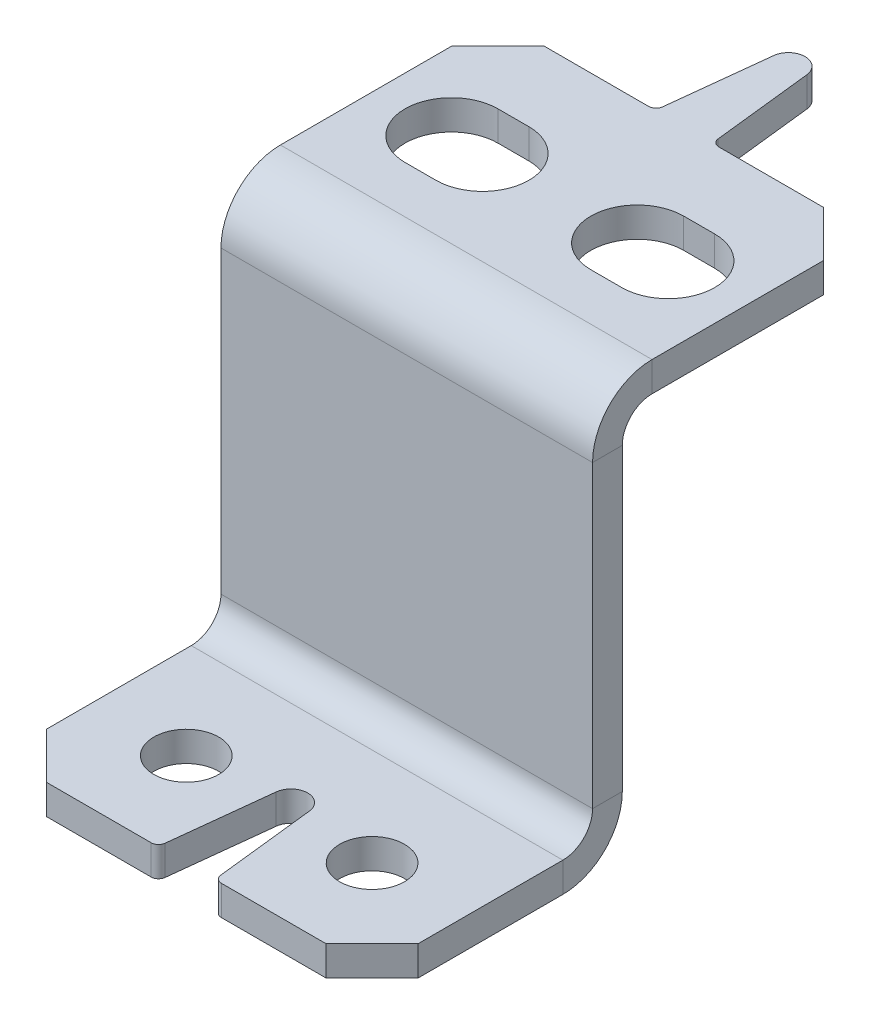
ISO-10303-21;
HEADER;
FILE_DESCRIPTION(('STEP AP214'),'2;1');
FILE_NAME('part.step','',(''),(''),'','','');
FILE_SCHEMA(('AUTOMOTIVE_DESIGN { 1 0 10303 214 1 1 1 1 }'));
ENDSEC;
DATA;
#1=APPLICATION_CONTEXT('core data for automotive mechanical design processes');
#2=APPLICATION_PROTOCOL_DEFINITION('international standard','automotive_design',2000,#1);
#3=PRODUCT_CONTEXT('',#1,'mechanical');
#4=PRODUCT('Part','Part','',(#3));
#5=PRODUCT_RELATED_PRODUCT_CATEGORY('part','',(#4));
#6=PRODUCT_DEFINITION_FORMATION('','',#4);
#7=PRODUCT_DEFINITION_CONTEXT('part definition',#1,'design');
#8=PRODUCT_DEFINITION('design','',#6,#7);
#9=PRODUCT_DEFINITION_SHAPE('','',#8);
#10=(LENGTH_UNIT() NAMED_UNIT(*) SI_UNIT(.MILLI.,.METRE.));
#11=(NAMED_UNIT(*) PLANE_ANGLE_UNIT() SI_UNIT($,.RADIAN.));
#12=(NAMED_UNIT(*) SI_UNIT($,.STERADIAN.) SOLID_ANGLE_UNIT());
#13=UNCERTAINTY_MEASURE_WITH_UNIT(LENGTH_MEASURE(1.E-05),#10,'distance_accuracy_value','');
#14=(GEOMETRIC_REPRESENTATION_CONTEXT(3) GLOBAL_UNCERTAINTY_ASSIGNED_CONTEXT((#13)) GLOBAL_UNIT_ASSIGNED_CONTEXT((#10,
#11,#12)) REPRESENTATION_CONTEXT('',''));
#15=CARTESIAN_POINT('',(0.,0.,0.));
#16=DIRECTION('',(0.,0.,1.));
#17=DIRECTION('',(1.,0.,0.));
#18=AXIS2_PLACEMENT_3D('',#15,#16,#17);
#19=CARTESIAN_POINT('',(9.525,-19.939,0.));
#20=DIRECTION('',(0.,-1.,0.));
#21=DIRECTION('',(0.,0.,-1.));
#22=AXIS2_PLACEMENT_3D('',#19,#20,#21);
#23=PLANE('',#22);
#24=CARTESIAN_POINT('',(-4.7625,-19.939,6.5405));
#25=DIRECTION('',(0.,1.,0.));
#26=DIRECTION('',(0.,0.,1.));
#27=AXIS2_PLACEMENT_3D('',#24,#25,#26);
#28=CIRCLE('',#27,1.6637);
#29=CARTESIAN_POINT('',(-4.7625,-19.939,8.2042));
#30=VERTEX_POINT('',#29);
#31=EDGE_CURVE('E383',#30,#30,#28,.T.);
#32=ORIENTED_EDGE('',*,*,#31,.F.);
#33=EDGE_LOOP('',(#32));
#34=FACE_BOUND('',#33,.T.);
#35=CARTESIAN_POINT('',(4.7625,-19.939,6.5405));
#36=DIRECTION('',(0.,1.,0.));
#37=DIRECTION('',(0.,0.,-1.));
#38=AXIS2_PLACEMENT_3D('',#35,#36,#37);
#39=CIRCLE('',#38,1.6637);
#40=CARTESIAN_POINT('',(4.7625,-19.939,8.2042));
#41=VERTEX_POINT('',#40);
#42=EDGE_CURVE('E373',#41,#41,#39,.T.);
#43=ORIENTED_EDGE('',*,*,#42,.F.);
#44=EDGE_LOOP('',(#43));
#45=FACE_BOUND('',#44,.T.);
#46=DIRECTION('',(-0.110923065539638,0.,-0.993828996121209));
#47=VECTOR('',#46,1.);
#48=CARTESIAN_POINT('',(0.850900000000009,-19.939,5.84121301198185));
#49=LINE('',#48,#47);
#50=CARTESIAN_POINT('',(1.42269279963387,-19.939,10.9642616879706));
#51=VERTEX_POINT('',#50);
#52=CARTESIAN_POINT('',(0.850900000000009,-19.939,5.84121301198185));
#53=VERTEX_POINT('',#52);
#54=EDGE_CURVE('E294',#51,#53,#49,.T.);
#55=ORIENTED_EDGE('',*,*,#54,.F.);
#56=CARTESIAN_POINT('',(1.80134164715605,-19.939,10.922));
#57=DIRECTION('',(0.,-1.,0.));
#58=DIRECTION('',(0.,0.,-1.));
#59=AXIS2_PLACEMENT_3D('',#56,#57,#58);
#60=CIRCLE('',#59,0.381);
#61=CARTESIAN_POINT('',(1.80134164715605,-19.939,11.303));
#62=VERTEX_POINT('',#61);
#63=EDGE_CURVE('E496',#51,#62,#60,.F.);
#64=ORIENTED_EDGE('',*,*,#63,.T.);
#65=DIRECTION('',(-1.,0.,0.));
#66=VECTOR('',#65,1.);
#67=CARTESIAN_POINT('',(9.525,-19.939,11.303));
#68=LINE('',#67,#66);
#69=CARTESIAN_POINT('',(7.16280000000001,-19.939,11.303));
#70=VERTEX_POINT('',#69);
#71=EDGE_CURVE('E613',#70,#62,#68,.T.);
#72=ORIENTED_EDGE('',*,*,#71,.F.);
#73=DIRECTION('',(-0.707106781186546,0.,0.707106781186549));
#74=VECTOR('',#73,1.);
#75=CARTESIAN_POINT('',(7.16280000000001,-19.939,11.303));
#76=LINE('',#75,#74);
#77=CARTESIAN_POINT('',(9.525,-19.939,8.9408));
#78=VERTEX_POINT('',#77);
#79=EDGE_CURVE('E581',#70,#78,#76,.F.);
#80=ORIENTED_EDGE('',*,*,#79,.T.);
#81=DIRECTION('',(0.,0.,1.));
#82=VECTOR('',#81,1.);
#83=CARTESIAN_POINT('',(9.525,-19.939,0.));
#84=LINE('',#83,#82);
#85=CARTESIAN_POINT('',(9.525,-19.939,1.524));
#86=VERTEX_POINT('',#85);
#87=EDGE_CURVE('E392',#86,#78,#84,.T.);
#88=ORIENTED_EDGE('',*,*,#87,.F.);
#89=DIRECTION('',(-1.,0.,0.));
#90=VECTOR('',#89,1.);
#91=CARTESIAN_POINT('',(9.525,-19.939,1.524));
#92=LINE('',#91,#90);
#93=CARTESIAN_POINT('',(-9.525,-19.939,1.524));
#94=VERTEX_POINT('',#93);
#95=EDGE_CURVE('E421',#86,#94,#92,.T.);
#96=ORIENTED_EDGE('',*,*,#95,.T.);
#97=DIRECTION('',(0.,0.,1.));
#98=VECTOR('',#97,1.);
#99=CARTESIAN_POINT('',(-9.525,-19.939,0.));
#100=LINE('',#99,#98);
#101=CARTESIAN_POINT('',(-9.525,-19.939,8.94080000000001));
#102=VERTEX_POINT('',#101);
#103=EDGE_CURVE('E389',#94,#102,#100,.T.);
#104=ORIENTED_EDGE('',*,*,#103,.T.);
#105=DIRECTION('',(-0.707106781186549,0.,-0.707106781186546));
#106=VECTOR('',#105,1.);
#107=CARTESIAN_POINT('',(-9.525,-19.939,8.94080000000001));
#108=LINE('',#107,#106);
#109=CARTESIAN_POINT('',(-7.16279999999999,-19.939,11.303));
#110=VERTEX_POINT('',#109);
#111=EDGE_CURVE('E583',#102,#110,#108,.F.);
#112=ORIENTED_EDGE('',*,*,#111,.T.);
#113=CARTESIAN_POINT('',(-1.80134164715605,-19.939,11.303));
#114=VERTEX_POINT('',#113);
#115=EDGE_CURVE('E618',#114,#110,#68,.T.);
#116=ORIENTED_EDGE('',*,*,#115,.F.);
#117=CARTESIAN_POINT('',(-1.80134164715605,-19.939,10.922));
#118=DIRECTION('',(0.,-1.,0.));
#119=DIRECTION('',(0.,0.,-1.));
#120=AXIS2_PLACEMENT_3D('',#117,#118,#119);
#121=CIRCLE('',#120,0.381);
#122=CARTESIAN_POINT('',(-1.42269279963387,-19.939,10.9642616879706));
#123=VERTEX_POINT('',#122);
#124=EDGE_CURVE('E58',#114,#123,#121,.F.);
#125=ORIENTED_EDGE('',*,*,#124,.T.);
#126=DIRECTION('',(-0.110923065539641,0.,0.993828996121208));
#127=VECTOR('',#126,1.);
#128=CARTESIAN_POINT('',(-0.850899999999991,-19.939,5.84121301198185));
#129=LINE('',#128,#127);
#130=CARTESIAN_POINT('',(-0.850899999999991,-19.939,5.84121301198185));
#131=VERTEX_POINT('',#130);
#132=EDGE_CURVE('E280',#131,#123,#129,.T.);
#133=ORIENTED_EDGE('',*,*,#132,.F.);
#134=CARTESIAN_POINT('',(0.,-19.939,5.93618351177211));
#135=DIRECTION('',(0.,1.,0.));
#136=DIRECTION('',(0.,0.,-1.));
#137=AXIS2_PLACEMENT_3D('',#134,#135,#136);
#138=CIRCLE('',#137,0.856183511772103);
#139=EDGE_CURVE('E783',#53,#131,#138,.T.);
#140=ORIENTED_EDGE('',*,*,#139,.F.);
#141=EDGE_LOOP('',(#55,#64,#72,#80,#88,#96,#104,#112,#116,#125,#133,#140));
#142=FACE_BOUND('',#141,.T.);
#143=ADVANCED_FACE('F36',(#34,#45,#142),#23,.F.);
#144=CARTESIAN_POINT('',(9.525,-21.463,11.303));
#145=DIRECTION('',(0.,0.,1.));
#146=DIRECTION('',(0.,-1.,0.));
#147=AXIS2_PLACEMENT_3D('',#144,#145,#146);
#148=PLANE('',#147);
#149=DIRECTION('',(-1.,0.,0.));
#150=VECTOR('',#149,1.);
#151=CARTESIAN_POINT('',(9.525,-21.463,11.303));
#152=LINE('',#151,#150);
#153=CARTESIAN_POINT('',(-1.80134164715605,-21.463,11.303));
#154=VERTEX_POINT('',#153);
#155=CARTESIAN_POINT('',(-7.16279999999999,-21.463,11.303));
#156=VERTEX_POINT('',#155);
#157=EDGE_CURVE('E780',#154,#156,#152,.T.);
#158=ORIENTED_EDGE('',*,*,#157,.F.);
#159=DIRECTION('',(0.,-1.,0.));
#160=VECTOR('',#159,1.);
#161=CARTESIAN_POINT('',(-1.80134164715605,-21.463,11.303));
#162=LINE('',#161,#160);
#163=EDGE_CURVE('E51',#154,#114,#162,.F.);
#164=ORIENTED_EDGE('',*,*,#163,.T.);
#165=ORIENTED_EDGE('',*,*,#115,.T.);
#166=DIRECTION('',(0.,-1.,0.));
#167=VECTOR('',#166,1.);
#168=CARTESIAN_POINT('',(-7.1628,-21.463,11.303));
#169=LINE('',#168,#167);
#170=EDGE_CURVE('E589',#110,#156,#169,.T.);
#171=ORIENTED_EDGE('',*,*,#170,.T.);
#172=EDGE_LOOP('',(#158,#164,#165,#171));
#173=FACE_BOUND('',#172,.T.);
#174=ADVANCED_FACE('F685',(#173),#148,.T.);
#175=ORIENTED_EDGE('',*,*,#71,.T.);
#176=DIRECTION('',(0.,-1.,0.));
#177=VECTOR('',#176,1.);
#178=CARTESIAN_POINT('',(1.80134164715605,-21.463,11.303));
#179=LINE('',#178,#177);
#180=CARTESIAN_POINT('',(1.80134164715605,-21.463,11.303));
#181=VERTEX_POINT('',#180);
#182=EDGE_CURVE('E487',#62,#181,#179,.T.);
#183=ORIENTED_EDGE('',*,*,#182,.T.);
#184=CARTESIAN_POINT('',(7.1628,-21.463,11.303));
#185=VERTEX_POINT('',#184);
#186=EDGE_CURVE('E615',#185,#181,#152,.T.);
#187=ORIENTED_EDGE('',*,*,#186,.F.);
#188=DIRECTION('',(0.,1.,0.));
#189=VECTOR('',#188,1.);
#190=CARTESIAN_POINT('',(7.16280000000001,-21.463,11.303));
#191=LINE('',#190,#189);
#192=EDGE_CURVE('E586',#185,#70,#191,.T.);
#193=ORIENTED_EDGE('',*,*,#192,.T.);
#194=EDGE_LOOP('',(#175,#183,#187,#193));
#195=FACE_BOUND('',#194,.T.);
#196=ADVANCED_FACE('F612',(#195),#148,.T.);
#197=CARTESIAN_POINT('',(9.525,-21.463,0.));
#198=DIRECTION('',(0.,-1.,0.));
#199=DIRECTION('',(0.,0.,-1.));
#200=AXIS2_PLACEMENT_3D('',#197,#198,#199);
#201=PLANE('',#200);
#202=CARTESIAN_POINT('',(-4.7625,-21.463,6.5405));
#203=DIRECTION('',(0.,1.,0.));
#204=DIRECTION('',(0.,0.,1.));
#205=AXIS2_PLACEMENT_3D('',#202,#203,#204);
#206=CIRCLE('',#205,1.6637);
#207=CARTESIAN_POINT('',(-4.7625,-21.463,8.2042));
#208=VERTEX_POINT('',#207);
#209=EDGE_CURVE('E386',#208,#208,#206,.T.);
#210=ORIENTED_EDGE('',*,*,#209,.T.);
#211=EDGE_LOOP('',(#210));
#212=FACE_BOUND('',#211,.T.);
#213=CARTESIAN_POINT('',(4.7625,-21.463,6.5405));
#214=DIRECTION('',(0.,1.,0.));
#215=DIRECTION('',(0.,0.,-1.));
#216=AXIS2_PLACEMENT_3D('',#213,#214,#215);
#217=CIRCLE('',#216,1.6637);
#218=CARTESIAN_POINT('',(4.7625,-21.463,8.2042));
#219=VERTEX_POINT('',#218);
#220=EDGE_CURVE('E380',#219,#219,#217,.T.);
#221=ORIENTED_EDGE('',*,*,#220,.T.);
#222=EDGE_LOOP('',(#221));
#223=FACE_BOUND('',#222,.T.);
#224=ORIENTED_EDGE('',*,*,#186,.T.);
#225=CARTESIAN_POINT('',(1.80134164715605,-21.463,10.922));
#226=DIRECTION('',(0.,-1.,0.));
#227=DIRECTION('',(0.,0.,-1.));
#228=AXIS2_PLACEMENT_3D('',#225,#226,#227);
#229=CIRCLE('',#228,0.381);
#230=CARTESIAN_POINT('',(1.42269279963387,-21.463,10.9642616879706));
#231=VERTEX_POINT('',#230);
#232=EDGE_CURVE('E276',#181,#231,#229,.T.);
#233=ORIENTED_EDGE('',*,*,#232,.T.);
#234=DIRECTION('',(-0.110923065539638,0.,-0.993828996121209));
#235=VECTOR('',#234,1.);
#236=CARTESIAN_POINT('',(0.850900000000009,-21.463,5.84121301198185));
#237=LINE('',#236,#235);
#238=CARTESIAN_POINT('',(0.850900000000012,-21.463,5.84121301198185));
#239=VERTEX_POINT('',#238);
#240=EDGE_CURVE('E270',#231,#239,#237,.T.);
#241=ORIENTED_EDGE('',*,*,#240,.T.);
#242=CARTESIAN_POINT('',(0.,-21.463,5.93618351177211));
#243=DIRECTION('',(0.,1.,0.));
#244=DIRECTION('',(0.,0.,1.));
#245=AXIS2_PLACEMENT_3D('',#242,#243,#244);
#246=CIRCLE('',#245,0.856183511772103);
#247=CARTESIAN_POINT('',(-0.850899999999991,-21.463,5.84121301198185));
#248=VERTEX_POINT('',#247);
#249=EDGE_CURVE('E275',#239,#248,#246,.T.);
#250=ORIENTED_EDGE('',*,*,#249,.T.);
#251=DIRECTION('',(-0.110923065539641,0.,0.993828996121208));
#252=VECTOR('',#251,1.);
#253=CARTESIAN_POINT('',(-0.850899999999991,-21.463,5.84121301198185));
#254=LINE('',#253,#252);
#255=CARTESIAN_POINT('',(-1.42269279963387,-21.463,10.9642616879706));
#256=VERTEX_POINT('',#255);
#257=EDGE_CURVE('E290',#248,#256,#254,.T.);
#258=ORIENTED_EDGE('',*,*,#257,.T.);
#259=CARTESIAN_POINT('',(-1.80134164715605,-21.463,10.922));
#260=DIRECTION('',(0.,-1.,0.));
#261=DIRECTION('',(0.,0.,-1.));
#262=AXIS2_PLACEMENT_3D('',#259,#260,#261);
#263=CIRCLE('',#262,0.381);
#264=EDGE_CURVE('E490',#256,#154,#263,.T.);
#265=ORIENTED_EDGE('',*,*,#264,.T.);
#266=ORIENTED_EDGE('',*,*,#157,.T.);
#267=DIRECTION('',(0.707106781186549,0.,0.707106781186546));
#268=VECTOR('',#267,1.);
#269=CARTESIAN_POINT('',(-4.47039999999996,-21.463,13.9954));
#270=LINE('',#269,#268);
#271=CARTESIAN_POINT('',(-9.525,-21.463,8.9408));
#272=VERTEX_POINT('',#271);
#273=EDGE_CURVE('E594',#156,#272,#270,.F.);
#274=ORIENTED_EDGE('',*,*,#273,.T.);
#275=DIRECTION('',(0.,0.,-1.));
#276=VECTOR('',#275,1.);
#277=CARTESIAN_POINT('',(-9.525,-21.463,0.));
#278=LINE('',#277,#276);
#279=CARTESIAN_POINT('',(-9.525,-21.463,1.524));
#280=VERTEX_POINT('',#279);
#281=EDGE_CURVE('E424',#280,#272,#278,.F.);
#282=ORIENTED_EDGE('',*,*,#281,.F.);
#283=DIRECTION('',(-1.,0.,0.));
#284=VECTOR('',#283,1.);
#285=CARTESIAN_POINT('',(9.525,-21.463,1.524));
#286=LINE('',#285,#284);
#287=CARTESIAN_POINT('',(9.525,-21.463,1.524));
#288=VERTEX_POINT('',#287);
#289=EDGE_CURVE('E606',#288,#280,#286,.T.);
#290=ORIENTED_EDGE('',*,*,#289,.F.);
#291=DIRECTION('',(0.,0.,-1.));
#292=VECTOR('',#291,1.);
#293=CARTESIAN_POINT('',(9.525,-21.463,0.));
#294=LINE('',#293,#292);
#295=CARTESIAN_POINT('',(9.525,-21.463,8.94079999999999));
#296=VERTEX_POINT('',#295);
#297=EDGE_CURVE('E395',#288,#296,#294,.F.);
#298=ORIENTED_EDGE('',*,*,#297,.T.);
#299=DIRECTION('',(0.707106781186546,0.,-0.707106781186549));
#300=VECTOR('',#299,1.);
#301=CARTESIAN_POINT('',(13.9954,-21.463,4.47039999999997));
#302=LINE('',#301,#300);
#303=EDGE_CURVE('E592',#296,#185,#302,.F.);
#304=ORIENTED_EDGE('',*,*,#303,.T.);
#305=EDGE_LOOP('',(#224,#233,#241,#250,#258,#265,#266,#274,#282,#290,#298,#304));
#306=FACE_BOUND('',#305,.T.);
#307=ADVANCED_FACE('F273',(#212,#223,#306),#201,.T.);
#308=CARTESIAN_POINT('',(9.525,0.,-14.1986));
#309=DIRECTION('',(0.,0.,-1.));
#310=DIRECTION('',(0.,1.,0.));
#311=AXIS2_PLACEMENT_3D('',#308,#309,#310);
#312=PLANE('',#311);
#313=DIRECTION('',(-1.,0.,0.));
#314=VECTOR('',#313,1.);
#315=CARTESIAN_POINT('',(9.525,-1.524,-14.1986));
#316=LINE('',#315,#314);
#317=CARTESIAN_POINT('',(7.1628,-1.524,-14.1986));
#318=VERTEX_POINT('',#317);
#319=CARTESIAN_POINT('',(1.80134164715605,-1.524,-14.1986));
#320=VERTEX_POINT('',#319);
#321=EDGE_CURVE('E474',#318,#320,#316,.T.);
#322=ORIENTED_EDGE('',*,*,#321,.T.);
#323=DIRECTION('',(0.,1.,0.));
#324=VECTOR('',#323,1.);
#325=CARTESIAN_POINT('',(1.80134164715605,0.,-14.1986));
#326=LINE('',#325,#324);
#327=CARTESIAN_POINT('',(1.80134164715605,0.,-14.1986));
#328=VERTEX_POINT('',#327);
#329=EDGE_CURVE('E483',#320,#328,#326,.T.);
#330=ORIENTED_EDGE('',*,*,#329,.T.);
#331=DIRECTION('',(-1.,0.,0.));
#332=VECTOR('',#331,1.);
#333=CARTESIAN_POINT('',(9.525,0.,-14.1986));
#334=LINE('',#333,#332);
#335=CARTESIAN_POINT('',(7.1628,0.,-14.1986));
#336=VERTEX_POINT('',#335);
#337=EDGE_CURVE('E469',#336,#328,#334,.T.);
#338=ORIENTED_EDGE('',*,*,#337,.F.);
#339=DIRECTION('',(0.,-1.,0.));
#340=VECTOR('',#339,1.);
#341=CARTESIAN_POINT('',(7.1628,0.,-14.1986));
#342=LINE('',#341,#340);
#343=EDGE_CURVE('E530',#336,#318,#342,.T.);
#344=ORIENTED_EDGE('',*,*,#343,.T.);
#345=EDGE_LOOP('',(#322,#330,#338,#344));
#346=FACE_BOUND('',#345,.T.);
#347=ADVANCED_FACE('F528',(#346),#312,.T.);
#348=CARTESIAN_POINT('',(9.525,0.,-3.048));
#349=DIRECTION('',(1.,0.,0.));
#350=DIRECTION('',(0.,0.,-1.));
#351=AXIS2_PLACEMENT_3D('',#348,#349,#350);
#352=PLANE('',#351);
#353=DIRECTION('',(0.,-1.,0.));
#354=VECTOR('',#353,1.);
#355=CARTESIAN_POINT('',(9.525,0.,-3.048));
#356=LINE('',#355,#354);
#357=CARTESIAN_POINT('',(9.525,0.,-3.048));
#358=VERTEX_POINT('',#357);
#359=CARTESIAN_POINT('',(9.525,-1.524,-3.048));
#360=VERTEX_POINT('',#359);
#361=EDGE_CURVE('E637',#358,#360,#356,.T.);
#362=ORIENTED_EDGE('',*,*,#361,.F.);
#363=CARTESIAN_POINT('',(9.525,-3.048,-3.048));
#364=DIRECTION('',(-1.,0.,0.));
#365=DIRECTION('',(0.,0.,1.));
#366=AXIS2_PLACEMENT_3D('',#363,#364,#365);
#367=CIRCLE('',#366,3.048);
#368=CARTESIAN_POINT('',(9.525,-3.048,0.));
#369=VERTEX_POINT('',#368);
#370=EDGE_CURVE('E412',#358,#369,#367,.F.);
#371=ORIENTED_EDGE('',*,*,#370,.T.);
#372=DIRECTION('',(0.,0.,1.));
#373=VECTOR('',#372,1.);
#374=CARTESIAN_POINT('',(9.525,-3.048,-1.524));
#375=LINE('',#374,#373);
#376=CARTESIAN_POINT('',(9.525,-3.048,-1.524));
#377=VERTEX_POINT('',#376);
#378=EDGE_CURVE('E635',#377,#369,#375,.T.);
#379=ORIENTED_EDGE('',*,*,#378,.F.);
#380=CARTESIAN_POINT('',(9.525,-3.048,-3.048));
#381=DIRECTION('',(1.,0.,0.));
#382=DIRECTION('',(0.,0.,-1.));
#383=AXIS2_PLACEMENT_3D('',#380,#381,#382);
#384=CIRCLE('',#383,1.524);
#385=EDGE_CURVE('E405',#360,#377,#384,.T.);
#386=ORIENTED_EDGE('',*,*,#385,.F.);
#387=EDGE_LOOP('',(#362,#371,#379,#386));
#388=FACE_BOUND('',#387,.T.);
#389=ADVANCED_FACE('F659',(#388),#352,.T.);
#390=CARTESIAN_POINT('',(9.525,-3.048,-1.524));
#391=DIRECTION('',(1.,0.,0.));
#392=DIRECTION('',(0.,0.,-1.));
#393=AXIS2_PLACEMENT_3D('',#390,#391,#392);
#394=PLANE('',#393);
#395=DIRECTION('',(0.,0.,-1.));
#396=VECTOR('',#395,1.);
#397=CARTESIAN_POINT('',(9.525,-1.524,0.));
#398=LINE('',#397,#396);
#399=CARTESIAN_POINT('',(9.525,-1.524,-11.8364));
#400=VERTEX_POINT('',#399);
#401=EDGE_CURVE('E408',#400,#360,#398,.F.);
#402=ORIENTED_EDGE('',*,*,#401,.F.);
#403=DIRECTION('',(0.,1.,0.));
#404=VECTOR('',#403,1.);
#405=CARTESIAN_POINT('',(9.525,-3.04800000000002,-11.8364));
#406=LINE('',#405,#404);
#407=CARTESIAN_POINT('',(9.525,0.,-11.8364));
#408=VERTEX_POINT('',#407);
#409=EDGE_CURVE('E573',#400,#408,#406,.T.);
#410=ORIENTED_EDGE('',*,*,#409,.T.);
#411=DIRECTION('',(0.,0.,1.));
#412=VECTOR('',#411,1.);
#413=CARTESIAN_POINT('',(9.525,0.,0.));
#414=LINE('',#413,#412);
#415=EDGE_CURVE('E410',#408,#358,#414,.T.);
#416=ORIENTED_EDGE('',*,*,#415,.T.);
#417=ORIENTED_EDGE('',*,*,#361,.T.);
#418=EDGE_LOOP('',(#402,#410,#416,#417));
#419=FACE_BOUND('',#418,.T.);
#420=ADVANCED_FACE('F665',(#419),#394,.T.);
#421=CARTESIAN_POINT('',(-9.525,-3.048,0.));
#422=DIRECTION('',(-1.,0.,0.));
#423=DIRECTION('',(0.,0.,1.));
#424=AXIS2_PLACEMENT_3D('',#421,#422,#423);
#425=PLANE('',#424);
#426=DIRECTION('',(0.,0.,-1.));
#427=VECTOR('',#426,1.);
#428=CARTESIAN_POINT('',(-9.525,-3.048,0.));
#429=LINE('',#428,#427);
#430=CARTESIAN_POINT('',(-9.525,-3.048,0.));
#431=VERTEX_POINT('',#430);
#432=CARTESIAN_POINT('',(-9.525,-3.048,-1.524));
#433=VERTEX_POINT('',#432);
#434=EDGE_CURVE('E633',#431,#433,#429,.T.);
#435=ORIENTED_EDGE('',*,*,#434,.F.);
#436=CARTESIAN_POINT('',(-9.525,-3.048,-3.048));
#437=DIRECTION('',(-1.,0.,0.));
#438=DIRECTION('',(0.,0.,1.));
#439=AXIS2_PLACEMENT_3D('',#436,#437,#438);
#440=CIRCLE('',#439,3.048);
#441=CARTESIAN_POINT('',(-9.525,0.,-3.048));
#442=VERTEX_POINT('',#441);
#443=EDGE_CURVE('E440',#442,#431,#440,.F.);
#444=ORIENTED_EDGE('',*,*,#443,.F.);
#445=DIRECTION('',(0.,1.,0.));
#446=VECTOR('',#445,1.);
#447=CARTESIAN_POINT('',(-9.525,-1.524,-3.048));
#448=LINE('',#447,#446);
#449=CARTESIAN_POINT('',(-9.525,-1.524,-3.048));
#450=VERTEX_POINT('',#449);
#451=EDGE_CURVE('E630',#450,#442,#448,.T.);
#452=ORIENTED_EDGE('',*,*,#451,.F.);
#453=CARTESIAN_POINT('',(-9.525,-3.048,-3.048));
#454=DIRECTION('',(1.,0.,0.));
#455=DIRECTION('',(0.,0.,-1.));
#456=AXIS2_PLACEMENT_3D('',#453,#454,#455);
#457=CIRCLE('',#456,1.524);
#458=EDGE_CURVE('E433',#450,#433,#457,.T.);
#459=ORIENTED_EDGE('',*,*,#458,.T.);
#460=EDGE_LOOP('',(#435,#444,#452,#459));
#461=FACE_BOUND('',#460,.T.);
#462=ADVANCED_FACE('F717',(#461),#425,.T.);
#463=CARTESIAN_POINT('',(-9.525,-1.524,-3.048));
#464=DIRECTION('',(-1.,0.,0.));
#465=DIRECTION('',(0.,0.,1.));
#466=AXIS2_PLACEMENT_3D('',#463,#464,#465);
#467=PLANE('',#466);
#468=DIRECTION('',(0.,-1.,0.));
#469=VECTOR('',#468,1.);
#470=CARTESIAN_POINT('',(-9.525,0.,0.));
#471=LINE('',#470,#469);
#472=CARTESIAN_POINT('',(-9.525,-18.415,0.));
#473=VERTEX_POINT('',#472);
#474=EDGE_CURVE('E443',#431,#473,#471,.T.);
#475=ORIENTED_EDGE('',*,*,#474,.F.);
#476=ORIENTED_EDGE('',*,*,#434,.T.);
#477=DIRECTION('',(0.,-1.,0.));
#478=VECTOR('',#477,1.);
#479=CARTESIAN_POINT('',(-9.525,0.,-1.524));
#480=LINE('',#479,#478);
#481=CARTESIAN_POINT('',(-9.525,-18.415,-1.524));
#482=VERTEX_POINT('',#481);
#483=EDGE_CURVE('E430',#433,#482,#480,.T.);
#484=ORIENTED_EDGE('',*,*,#483,.T.);
#485=DIRECTION('',(0.,0.,1.));
#486=VECTOR('',#485,1.);
#487=CARTESIAN_POINT('',(-9.525,-18.415,-1.524));
#488=LINE('',#487,#486);
#489=EDGE_CURVE('E617',#482,#473,#488,.T.);
#490=ORIENTED_EDGE('',*,*,#489,.T.);
#491=EDGE_LOOP('',(#475,#476,#484,#490));
#492=FACE_BOUND('',#491,.T.);
#493=ADVANCED_FACE('F713',(#492),#467,.T.);
#494=CARTESIAN_POINT('',(9.525,-18.415,0.));
#495=DIRECTION('',(1.,0.,0.));
#496=DIRECTION('',(0.,0.,-1.));
#497=AXIS2_PLACEMENT_3D('',#494,#495,#496);
#498=PLANE('',#497);
#499=DIRECTION('',(0.,0.,-1.));
#500=VECTOR('',#499,1.);
#501=CARTESIAN_POINT('',(9.525,-18.415,0.));
#502=LINE('',#501,#500);
#503=CARTESIAN_POINT('',(9.525,-18.415,0.));
#504=VERTEX_POINT('',#503);
#505=CARTESIAN_POINT('',(9.525,-18.415,-1.524));
#506=VERTEX_POINT('',#505);
#507=EDGE_CURVE('E628',#504,#506,#502,.T.);
#508=ORIENTED_EDGE('',*,*,#507,.F.);
#509=CARTESIAN_POINT('',(9.525,-18.415,1.524));
#510=DIRECTION('',(1.,0.,0.));
#511=DIRECTION('',(0.,0.,-1.));
#512=AXIS2_PLACEMENT_3D('',#509,#510,#511);
#513=CIRCLE('',#512,1.524);
#514=EDGE_CURVE('E418',#504,#86,#513,.F.);
#515=ORIENTED_EDGE('',*,*,#514,.T.);
#516=DIRECTION('',(0.,1.,0.));
#517=VECTOR('',#516,1.);
#518=CARTESIAN_POINT('',(9.525,-21.463,1.524));
#519=LINE('',#518,#517);
#520=EDGE_CURVE('E626',#288,#86,#519,.T.);
#521=ORIENTED_EDGE('',*,*,#520,.F.);
#522=CARTESIAN_POINT('',(9.525,-18.415,1.524));
#523=DIRECTION('',(1.,0.,0.));
#524=DIRECTION('',(0.,0.,-1.));
#525=AXIS2_PLACEMENT_3D('',#522,#523,#524);
#526=CIRCLE('',#525,3.048);
#527=EDGE_CURVE('E399',#506,#288,#526,.F.);
#528=ORIENTED_EDGE('',*,*,#527,.F.);
#529=EDGE_LOOP('',(#508,#515,#521,#528));
#530=FACE_BOUND('',#529,.T.);
#531=ADVANCED_FACE('F709',(#530),#498,.T.);
#532=CARTESIAN_POINT('',(9.525,-21.463,1.524));
#533=DIRECTION('',(1.,0.,0.));
#534=DIRECTION('',(0.,0.,-1.));
#535=AXIS2_PLACEMENT_3D('',#532,#533,#534);
#536=PLANE('',#535);
#537=DIRECTION('',(0.,-1.,0.));
#538=VECTOR('',#537,1.);
#539=CARTESIAN_POINT('',(9.525,0.,0.));
#540=LINE('',#539,#538);
#541=EDGE_CURVE('E415',#369,#504,#540,.T.);
#542=ORIENTED_EDGE('',*,*,#541,.T.);
#543=ORIENTED_EDGE('',*,*,#507,.T.);
#544=DIRECTION('',(0.,-1.,0.));
#545=VECTOR('',#544,1.);
#546=CARTESIAN_POINT('',(9.525,0.,-1.524));
#547=LINE('',#546,#545);
#548=EDGE_CURVE('E402',#377,#506,#547,.T.);
#549=ORIENTED_EDGE('',*,*,#548,.F.);
#550=ORIENTED_EDGE('',*,*,#378,.T.);
#551=EDGE_LOOP('',(#542,#543,#549,#550));
#552=FACE_BOUND('',#551,.T.);
#553=ADVANCED_FACE('F705',(#552),#536,.T.);
#554=CARTESIAN_POINT('',(-9.525,-19.939,1.524));
#555=DIRECTION('',(-1.,0.,0.));
#556=DIRECTION('',(0.,0.,1.));
#557=AXIS2_PLACEMENT_3D('',#554,#555,#556);
#558=PLANE('',#557);
#559=DIRECTION('',(0.,-1.,0.));
#560=VECTOR('',#559,1.);
#561=CARTESIAN_POINT('',(-9.525,-19.939,1.524));
#562=LINE('',#561,#560);
#563=EDGE_CURVE('E620',#94,#280,#562,.T.);
#564=ORIENTED_EDGE('',*,*,#563,.F.);
#565=CARTESIAN_POINT('',(-9.525,-18.415,1.524));
#566=DIRECTION('',(1.,0.,0.));
#567=DIRECTION('',(0.,0.,-1.));
#568=AXIS2_PLACEMENT_3D('',#565,#566,#567);
#569=CIRCLE('',#568,1.524);
#570=EDGE_CURVE('E396',#473,#94,#569,.F.);
#571=ORIENTED_EDGE('',*,*,#570,.F.);
#572=ORIENTED_EDGE('',*,*,#489,.F.);
#573=CARTESIAN_POINT('',(-9.525,-18.415,1.524));
#574=DIRECTION('',(1.,0.,0.));
#575=DIRECTION('',(0.,0.,-1.));
#576=AXIS2_PLACEMENT_3D('',#573,#574,#575);
#577=CIRCLE('',#576,3.048);
#578=EDGE_CURVE('E427',#482,#280,#577,.F.);
#579=ORIENTED_EDGE('',*,*,#578,.T.);
#580=EDGE_LOOP('',(#564,#571,#572,#579));
#581=FACE_BOUND('',#580,.T.);
#582=ADVANCED_FACE('F701',(#581),#558,.T.);
#583=CARTESIAN_POINT('',(-9.525,-18.415,-1.524));
#584=DIRECTION('',(-1.,0.,0.));
#585=DIRECTION('',(0.,0.,1.));
#586=AXIS2_PLACEMENT_3D('',#583,#584,#585);
#587=PLANE('',#586);
#588=ORIENTED_EDGE('',*,*,#281,.T.);
#589=DIRECTION('',(0.,1.,0.));
#590=VECTOR('',#589,1.);
#591=CARTESIAN_POINT('',(-9.525,-18.415,8.94080000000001));
#592=LINE('',#591,#590);
#593=EDGE_CURVE('E575',#272,#102,#592,.T.);
#594=ORIENTED_EDGE('',*,*,#593,.T.);
#595=ORIENTED_EDGE('',*,*,#103,.F.);
#596=ORIENTED_EDGE('',*,*,#563,.T.);
#597=EDGE_LOOP('',(#588,#594,#595,#596));
#598=FACE_BOUND('',#597,.T.);
#599=ADVANCED_FACE('F697',(#598),#587,.T.);
#600=CARTESIAN_POINT('',(9.525,-18.415,1.524));
#601=DIRECTION('',(-1.,0.,0.));
#602=DIRECTION('',(0.,0.,1.));
#603=AXIS2_PLACEMENT_3D('',#600,#601,#602);
#604=CYLINDRICAL_SURFACE('',#603,3.048);
#605=ORIENTED_EDGE('',*,*,#578,.F.);
#606=DIRECTION('',(-1.,0.,0.));
#607=VECTOR('',#606,1.);
#608=CARTESIAN_POINT('',(9.525,-18.415,-1.524));
#609=LINE('',#608,#607);
#610=EDGE_CURVE('E759',#506,#482,#609,.T.);
#611=ORIENTED_EDGE('',*,*,#610,.F.);
#612=ORIENTED_EDGE('',*,*,#527,.T.);
#613=ORIENTED_EDGE('',*,*,#289,.T.);
#614=EDGE_LOOP('',(#605,#611,#612,#613));
#615=FACE_BOUND('',#614,.T.);
#616=ADVANCED_FACE('F700',(#615),#604,.T.);
#617=CARTESIAN_POINT('',(9.525,0.,-1.524));
#618=DIRECTION('',(0.,0.,-1.));
#619=DIRECTION('',(0.,1.,0.));
#620=AXIS2_PLACEMENT_3D('',#617,#618,#619);
#621=PLANE('',#620);
#622=ORIENTED_EDGE('',*,*,#483,.F.);
#623=DIRECTION('',(-1.,0.,0.));
#624=VECTOR('',#623,1.);
#625=CARTESIAN_POINT('',(9.525,-3.048,-1.524));
#626=LINE('',#625,#624);
#627=EDGE_CURVE('E533',#377,#433,#626,.T.);
#628=ORIENTED_EDGE('',*,*,#627,.F.);
#629=ORIENTED_EDGE('',*,*,#548,.T.);
#630=ORIENTED_EDGE('',*,*,#610,.T.);
#631=EDGE_LOOP('',(#622,#628,#629,#630));
#632=FACE_BOUND('',#631,.T.);
#633=ADVANCED_FACE('F745',(#632),#621,.T.);
#634=CARTESIAN_POINT('',(9.525,-3.048,-3.048));
#635=DIRECTION('',(-1.,0.,0.));
#636=DIRECTION('',(0.,0.,1.));
#637=AXIS2_PLACEMENT_3D('',#634,#635,#636);
#638=CYLINDRICAL_SURFACE('',#637,1.524);
#639=ORIENTED_EDGE('',*,*,#458,.F.);
#640=DIRECTION('',(-1.,0.,0.));
#641=VECTOR('',#640,1.);
#642=CARTESIAN_POINT('',(9.525,-1.524,-3.048));
#643=LINE('',#642,#641);
#644=EDGE_CURVE('E531',#360,#450,#643,.T.);
#645=ORIENTED_EDGE('',*,*,#644,.F.);
#646=ORIENTED_EDGE('',*,*,#385,.T.);
#647=ORIENTED_EDGE('',*,*,#627,.T.);
#648=EDGE_LOOP('',(#639,#645,#646,#647));
#649=FACE_BOUND('',#648,.T.);
#650=ADVANCED_FACE('F669',(#649),#638,.F.);
#651=CARTESIAN_POINT('',(9.525,-1.524,0.));
#652=DIRECTION('',(0.,-1.,0.));
#653=DIRECTION('',(0.,0.,-1.));
#654=AXIS2_PLACEMENT_3D('',#651,#652,#653);
#655=PLANE('',#654);
#656=CARTESIAN_POINT('',(5.55625,-1.524,-7.8486));
#657=DIRECTION('',(0.,1.,0.));
#658=DIRECTION('',(0.,0.,-1.));
#659=AXIS2_PLACEMENT_3D('',#656,#657,#658);
#660=CIRCLE('',#659,2.38124999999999);
#661=CARTESIAN_POINT('',(5.55625,-1.524,-5.46735000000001));
#662=VERTEX_POINT('',#661);
#663=CARTESIAN_POINT('',(5.55625,-1.524,-10.22985));
#664=VERTEX_POINT('',#663);
#665=EDGE_CURVE('E316',#662,#664,#660,.T.);
#666=ORIENTED_EDGE('',*,*,#665,.T.);
#667=DIRECTION('',(-1.,0.,0.));
#668=VECTOR('',#667,1.);
#669=CARTESIAN_POINT('',(5.55625,-1.524,-10.22985));
#670=LINE('',#669,#668);
#671=CARTESIAN_POINT('',(3.96874999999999,-1.524,-10.22985));
#672=VERTEX_POINT('',#671);
#673=EDGE_CURVE('E319',#664,#672,#670,.T.);
#674=ORIENTED_EDGE('',*,*,#673,.T.);
#675=CARTESIAN_POINT('',(3.96874999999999,-1.524,-7.84859999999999));
#676=DIRECTION('',(0.,1.,0.));
#677=DIRECTION('',(0.,0.,-1.));
#678=AXIS2_PLACEMENT_3D('',#675,#676,#677);
#679=CIRCLE('',#678,2.38124999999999);
#680=CARTESIAN_POINT('',(3.96874999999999,-1.524,-5.46735));
#681=VERTEX_POINT('',#680);
#682=EDGE_CURVE('E323',#672,#681,#679,.T.);
#683=ORIENTED_EDGE('',*,*,#682,.T.);
#684=DIRECTION('',(1.,0.,0.));
#685=VECTOR('',#684,1.);
#686=CARTESIAN_POINT('',(5.55625,-1.524,-5.46735000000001));
#687=LINE('',#686,#685);
#688=EDGE_CURVE('E326',#681,#662,#687,.T.);
#689=ORIENTED_EDGE('',*,*,#688,.T.);
#690=EDGE_LOOP('',(#666,#674,#683,#689));
#691=FACE_BOUND('',#690,.T.);
#692=CARTESIAN_POINT('',(-5.55625,-1.524,-7.8486));
#693=DIRECTION('',(0.,1.,0.));
#694=DIRECTION('',(0.,0.,1.));
#695=AXIS2_PLACEMENT_3D('',#692,#693,#694);
#696=CIRCLE('',#695,2.38124999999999);
#697=CARTESIAN_POINT('',(-5.55625,-1.524,-10.22985));
#698=VERTEX_POINT('',#697);
#699=CARTESIAN_POINT('',(-5.55625,-1.524,-5.46735000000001));
#700=VERTEX_POINT('',#699);
#701=EDGE_CURVE('E348',#698,#700,#696,.T.);
#702=ORIENTED_EDGE('',*,*,#701,.T.);
#703=DIRECTION('',(1.,0.,0.));
#704=VECTOR('',#703,1.);
#705=CARTESIAN_POINT('',(-5.55625,-1.524,-5.46735000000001));
#706=LINE('',#705,#704);
#707=CARTESIAN_POINT('',(-3.96874999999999,-1.524,-5.46735000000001));
#708=VERTEX_POINT('',#707);
#709=EDGE_CURVE('E351',#700,#708,#706,.T.);
#710=ORIENTED_EDGE('',*,*,#709,.T.);
#711=CARTESIAN_POINT('',(-3.96874999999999,-1.524,-7.8486));
#712=DIRECTION('',(0.,1.,0.));
#713=DIRECTION('',(0.,0.,1.));
#714=AXIS2_PLACEMENT_3D('',#711,#712,#713);
#715=CIRCLE('',#714,2.38124999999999);
#716=CARTESIAN_POINT('',(-3.96874999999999,-1.524,-10.22985));
#717=VERTEX_POINT('',#716);
#718=EDGE_CURVE('E355',#708,#717,#715,.T.);
#719=ORIENTED_EDGE('',*,*,#718,.T.);
#720=DIRECTION('',(-1.,0.,0.));
#721=VECTOR('',#720,1.);
#722=CARTESIAN_POINT('',(-5.55625,-1.524,-10.22985));
#723=LINE('',#722,#721);
#724=EDGE_CURVE('E358',#717,#698,#723,.T.);
#725=ORIENTED_EDGE('',*,*,#724,.T.);
#726=EDGE_LOOP('',(#702,#710,#719,#725));
#727=FACE_BOUND('',#726,.T.);
#728=DIRECTION('',(0.,0.,-1.));
#729=VECTOR('',#728,1.);
#730=CARTESIAN_POINT('',(-9.525,-1.524,0.));
#731=LINE('',#730,#729);
#732=CARTESIAN_POINT('',(-9.525,-1.524,-11.8364));
#733=VERTEX_POINT('',#732);
#734=EDGE_CURVE('E436',#733,#450,#731,.F.);
#735=ORIENTED_EDGE('',*,*,#734,.F.);
#736=DIRECTION('',(0.70710678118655,0.,-0.707106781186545));
#737=VECTOR('',#736,1.);
#738=CARTESIAN_POINT('',(-5.91819999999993,-1.524,-15.4432000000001));
#739=LINE('',#738,#737);
#740=CARTESIAN_POINT('',(-7.16279999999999,-1.524,-14.1986));
#741=VERTEX_POINT('',#740);
#742=EDGE_CURVE('E643',#733,#741,#739,.T.);
#743=ORIENTED_EDGE('',*,*,#742,.T.);
#744=CARTESIAN_POINT('',(-1.80134164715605,-1.524,-14.1986));
#745=VERTEX_POINT('',#744);
#746=EDGE_CURVE('E473',#745,#741,#316,.T.);
#747=ORIENTED_EDGE('',*,*,#746,.F.);
#748=CARTESIAN_POINT('',(-1.80134164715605,-1.524,-14.5796));
#749=DIRECTION('',(0.,-1.,0.));
#750=DIRECTION('',(0.,0.,-1.));
#751=AXIS2_PLACEMENT_3D('',#748,#749,#750);
#752=CIRCLE('',#751,0.381);
#753=CARTESIAN_POINT('',(-1.42269279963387,-1.524,-14.5373383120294));
#754=VERTEX_POINT('',#753);
#755=EDGE_CURVE('E504',#745,#754,#752,.F.);
#756=ORIENTED_EDGE('',*,*,#755,.T.);
#757=DIRECTION('',(-0.11092306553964,0.,0.993828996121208));
#758=VECTOR('',#757,1.);
#759=CARTESIAN_POINT('',(-0.8509,-1.524,-19.6603869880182));
#760=LINE('',#759,#758);
#761=CARTESIAN_POINT('',(-0.8509,-1.524,-19.6603869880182));
#762=VERTEX_POINT('',#761);
#763=EDGE_CURVE('E304',#762,#754,#760,.T.);
#764=ORIENTED_EDGE('',*,*,#763,.F.);
#765=CARTESIAN_POINT('',(0.,-1.524,-19.5654164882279));
#766=DIRECTION('',(0.,1.,0.));
#767=DIRECTION('',(0.,0.,-1.));
#768=AXIS2_PLACEMENT_3D('',#765,#766,#767);
#769=CIRCLE('',#768,0.856183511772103);
#770=CARTESIAN_POINT('',(0.8509,-1.524,-19.6603869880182));
#771=VERTEX_POINT('',#770);
#772=EDGE_CURVE('E301',#771,#762,#769,.T.);
#773=ORIENTED_EDGE('',*,*,#772,.F.);
#774=DIRECTION('',(-0.11092306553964,0.,-0.993828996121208));
#775=VECTOR('',#774,1.);
#776=CARTESIAN_POINT('',(0.8509,-1.524,-19.6603869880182));
#777=LINE('',#776,#775);
#778=CARTESIAN_POINT('',(1.42269279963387,-1.524,-14.5373383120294));
#779=VERTEX_POINT('',#778);
#780=EDGE_CURVE('E315',#779,#771,#777,.T.);
#781=ORIENTED_EDGE('',*,*,#780,.F.);
#782=CARTESIAN_POINT('',(1.80134164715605,-1.524,-14.5796));
#783=DIRECTION('',(0.,-1.,0.));
#784=DIRECTION('',(0.,0.,-1.));
#785=AXIS2_PLACEMENT_3D('',#782,#783,#784);
#786=CIRCLE('',#785,0.381);
#787=EDGE_CURVE('E11',#779,#320,#786,.F.);
#788=ORIENTED_EDGE('',*,*,#787,.T.);
#789=ORIENTED_EDGE('',*,*,#321,.F.);
#790=DIRECTION('',(-0.707106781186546,0.,-0.707106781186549));
#791=VECTOR('',#790,1.);
#792=CARTESIAN_POINT('',(15.4432,-1.524,-5.91819999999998));
#793=LINE('',#792,#791);
#794=EDGE_CURVE('E641',#318,#400,#793,.F.);
#795=ORIENTED_EDGE('',*,*,#794,.T.);
#796=ORIENTED_EDGE('',*,*,#401,.T.);
#797=ORIENTED_EDGE('',*,*,#644,.T.);
#798=EDGE_LOOP('',(#735,#743,#747,#756,#764,#773,#781,#788,#789,#795,#796,#797));
#799=FACE_BOUND('',#798,.T.);
#800=ADVANCED_FACE('F524',(#691,#727,#799),#655,.T.);
#801=CARTESIAN_POINT('',(-1.80134164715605,0.,-14.1986));
#802=VERTEX_POINT('',#801);
#803=CARTESIAN_POINT('',(-7.16279999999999,0.,-14.1986));
#804=VERTEX_POINT('',#803);
#805=EDGE_CURVE('E459',#802,#804,#334,.T.);
#806=ORIENTED_EDGE('',*,*,#805,.F.);
#807=DIRECTION('',(0.,1.,0.));
#808=VECTOR('',#807,1.);
#809=CARTESIAN_POINT('',(-1.80134164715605,-1.524,-14.1986));
#810=LINE('',#809,#808);
#811=EDGE_CURVE('E542',#802,#745,#810,.F.);
#812=ORIENTED_EDGE('',*,*,#811,.T.);
#813=ORIENTED_EDGE('',*,*,#746,.T.);
#814=DIRECTION('',(0.,1.,0.));
#815=VECTOR('',#814,1.);
#816=CARTESIAN_POINT('',(-7.1628,0.,-14.1986));
#817=LINE('',#816,#815);
#818=EDGE_CURVE('E562',#741,#804,#817,.T.);
#819=ORIENTED_EDGE('',*,*,#818,.T.);
#820=EDGE_LOOP('',(#806,#812,#813,#819));
#821=FACE_BOUND('',#820,.T.);
#822=ADVANCED_FACE('F560',(#821),#312,.T.);
#823=CARTESIAN_POINT('',(9.525,0.,0.));
#824=DIRECTION('',(0.,-1.,0.));
#825=DIRECTION('',(0.,0.,-1.));
#826=AXIS2_PLACEMENT_3D('',#823,#824,#825);
#827=PLANE('',#826);
#828=DIRECTION('',(-1.,0.,0.));
#829=VECTOR('',#828,1.);
#830=CARTESIAN_POINT('',(5.55625,0.,-10.22985));
#831=LINE('',#830,#829);
#832=CARTESIAN_POINT('',(5.55625,0.,-10.22985));
#833=VERTEX_POINT('',#832);
#834=CARTESIAN_POINT('',(3.96874999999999,0.,-10.22985));
#835=VERTEX_POINT('',#834);
#836=EDGE_CURVE('E331',#833,#835,#831,.T.);
#837=ORIENTED_EDGE('',*,*,#836,.F.);
#838=CARTESIAN_POINT('',(5.55625,0.,-7.8486));
#839=DIRECTION('',(0.,1.,0.));
#840=DIRECTION('',(0.,0.,-1.));
#841=AXIS2_PLACEMENT_3D('',#838,#839,#840);
#842=CIRCLE('',#841,2.38124999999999);
#843=CARTESIAN_POINT('',(5.55625,0.,-5.46735000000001));
#844=VERTEX_POINT('',#843);
#845=EDGE_CURVE('E312',#844,#833,#842,.T.);
#846=ORIENTED_EDGE('',*,*,#845,.F.);
#847=DIRECTION('',(1.,0.,0.));
#848=VECTOR('',#847,1.);
#849=CARTESIAN_POINT('',(5.55625,0.,-5.46735000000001));
#850=LINE('',#849,#848);
#851=CARTESIAN_POINT('',(3.96874999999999,0.,-5.46735));
#852=VERTEX_POINT('',#851);
#853=EDGE_CURVE('E320',#852,#844,#850,.T.);
#854=ORIENTED_EDGE('',*,*,#853,.F.);
#855=CARTESIAN_POINT('',(3.96874999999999,0.,-7.84859999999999));
#856=DIRECTION('',(0.,1.,0.));
#857=DIRECTION('',(0.,0.,-1.));
#858=AXIS2_PLACEMENT_3D('',#855,#856,#857);
#859=CIRCLE('',#858,2.38124999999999);
#860=EDGE_CURVE('E334',#835,#852,#859,.T.);
#861=ORIENTED_EDGE('',*,*,#860,.F.);
#862=EDGE_LOOP('',(#837,#846,#854,#861));
#863=FACE_BOUND('',#862,.T.);
#864=DIRECTION('',(1.,0.,0.));
#865=VECTOR('',#864,1.);
#866=CARTESIAN_POINT('',(-5.55625,0.,-5.46735000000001));
#867=LINE('',#866,#865);
#868=CARTESIAN_POINT('',(-5.55625,0.,-5.46735));
#869=VERTEX_POINT('',#868);
#870=CARTESIAN_POINT('',(-3.96874999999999,0.,-5.46735000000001));
#871=VERTEX_POINT('',#870);
#872=EDGE_CURVE('E363',#869,#871,#867,.T.);
#873=ORIENTED_EDGE('',*,*,#872,.F.);
#874=CARTESIAN_POINT('',(-5.55625,0.,-7.8486));
#875=DIRECTION('',(0.,1.,0.));
#876=DIRECTION('',(0.,0.,1.));
#877=AXIS2_PLACEMENT_3D('',#874,#875,#876);
#878=CIRCLE('',#877,2.38124999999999);
#879=CARTESIAN_POINT('',(-5.55625,0.,-10.22985));
#880=VERTEX_POINT('',#879);
#881=EDGE_CURVE('E341',#880,#869,#878,.T.);
#882=ORIENTED_EDGE('',*,*,#881,.F.);
#883=DIRECTION('',(-1.,0.,0.));
#884=VECTOR('',#883,1.);
#885=CARTESIAN_POINT('',(-5.55625,0.,-10.22985));
#886=LINE('',#885,#884);
#887=CARTESIAN_POINT('',(-3.96874999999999,0.,-10.22985));
#888=VERTEX_POINT('',#887);
#889=EDGE_CURVE('E352',#888,#880,#886,.T.);
#890=ORIENTED_EDGE('',*,*,#889,.F.);
#891=CARTESIAN_POINT('',(-3.96874999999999,0.,-7.8486));
#892=DIRECTION('',(0.,1.,0.));
#893=DIRECTION('',(0.,0.,1.));
#894=AXIS2_PLACEMENT_3D('',#891,#892,#893);
#895=CIRCLE('',#894,2.38124999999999);
#896=EDGE_CURVE('E366',#871,#888,#895,.T.);
#897=ORIENTED_EDGE('',*,*,#896,.F.);
#898=EDGE_LOOP('',(#873,#882,#890,#897));
#899=FACE_BOUND('',#898,.T.);
#900=ORIENTED_EDGE('',*,*,#337,.T.);
#901=CARTESIAN_POINT('',(1.80134164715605,0.,-14.5796));
#902=DIRECTION('',(0.,-1.,0.));
#903=DIRECTION('',(0.,0.,-1.));
#904=AXIS2_PLACEMENT_3D('',#901,#902,#903);
#905=CIRCLE('',#904,0.381);
#906=CARTESIAN_POINT('',(1.42269279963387,0.,-14.5373383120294));
#907=VERTEX_POINT('',#906);
#908=EDGE_CURVE('E44',#328,#907,#905,.T.);
#909=ORIENTED_EDGE('',*,*,#908,.T.);
#910=DIRECTION('',(-0.11092306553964,0.,-0.993828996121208));
#911=VECTOR('',#910,1.);
#912=CARTESIAN_POINT('',(0.8509,0.,-19.6603869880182));
#913=LINE('',#912,#911);
#914=CARTESIAN_POINT('',(0.8509,0.,-19.6603869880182));
#915=VERTEX_POINT('',#914);
#916=EDGE_CURVE('E305',#907,#915,#913,.T.);
#917=ORIENTED_EDGE('',*,*,#916,.T.);
#918=CARTESIAN_POINT('',(0.,0.,-19.5654164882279));
#919=DIRECTION('',(0.,1.,0.));
#920=DIRECTION('',(0.,0.,-1.));
#921=AXIS2_PLACEMENT_3D('',#918,#919,#920);
#922=CIRCLE('',#921,0.856183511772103);
#923=CARTESIAN_POINT('',(-0.8509,0.,-19.6603869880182));
#924=VERTEX_POINT('',#923);
#925=EDGE_CURVE('E296',#915,#924,#922,.T.);
#926=ORIENTED_EDGE('',*,*,#925,.T.);
#927=DIRECTION('',(-0.11092306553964,0.,0.993828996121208));
#928=VECTOR('',#927,1.);
#929=CARTESIAN_POINT('',(-0.8509,0.,-19.6603869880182));
#930=LINE('',#929,#928);
#931=CARTESIAN_POINT('',(-1.42269279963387,0.,-14.5373383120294));
#932=VERTEX_POINT('',#931);
#933=EDGE_CURVE('E308',#924,#932,#930,.T.);
#934=ORIENTED_EDGE('',*,*,#933,.T.);
#935=CARTESIAN_POINT('',(-1.80134164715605,0.,-14.5796));
#936=DIRECTION('',(0.,-1.,0.));
#937=DIRECTION('',(0.,0.,-1.));
#938=AXIS2_PLACEMENT_3D('',#935,#936,#937);
#939=CIRCLE('',#938,0.381);
#940=EDGE_CURVE('E502',#932,#802,#939,.T.);
#941=ORIENTED_EDGE('',*,*,#940,.T.);
#942=ORIENTED_EDGE('',*,*,#805,.T.);
#943=DIRECTION('',(-0.70710678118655,0.,0.707106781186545));
#944=VECTOR('',#943,1.);
#945=CARTESIAN_POINT('',(-9.52500000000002,0.,-11.8364));
#946=LINE('',#945,#944);
#947=CARTESIAN_POINT('',(-9.525,0.,-11.8364));
#948=VERTEX_POINT('',#947);
#949=EDGE_CURVE('E568',#804,#948,#946,.T.);
#950=ORIENTED_EDGE('',*,*,#949,.T.);
#951=DIRECTION('',(0.,0.,1.));
#952=VECTOR('',#951,1.);
#953=CARTESIAN_POINT('',(-9.525,0.,0.));
#954=LINE('',#953,#952);
#955=EDGE_CURVE('E438',#948,#442,#954,.T.);
#956=ORIENTED_EDGE('',*,*,#955,.T.);
#957=DIRECTION('',(-1.,0.,0.));
#958=VECTOR('',#957,1.);
#959=CARTESIAN_POINT('',(9.525,0.,-3.048));
#960=LINE('',#959,#958);
#961=EDGE_CURVE('E456',#358,#442,#960,.T.);
#962=ORIENTED_EDGE('',*,*,#961,.F.);
#963=ORIENTED_EDGE('',*,*,#415,.F.);
#964=DIRECTION('',(0.707106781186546,0.,0.707106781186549));
#965=VECTOR('',#964,1.);
#966=CARTESIAN_POINT('',(7.1628,0.,-14.1986));
#967=LINE('',#966,#965);
#968=EDGE_CURVE('E565',#408,#336,#967,.F.);
#969=ORIENTED_EDGE('',*,*,#968,.T.);
#970=EDGE_LOOP('',(#900,#909,#917,#926,#934,#941,#942,#950,#956,#962,#963,#969));
#971=FACE_BOUND('',#970,.T.);
#972=ADVANCED_FACE('F507',(#863,#899,#971),#827,.F.);
#973=CARTESIAN_POINT('',(9.525,-3.048,-3.048));
#974=DIRECTION('',(-1.,0.,0.));
#975=DIRECTION('',(0.,0.,1.));
#976=AXIS2_PLACEMENT_3D('',#973,#974,#975);
#977=CYLINDRICAL_SURFACE('',#976,3.048);
#978=ORIENTED_EDGE('',*,*,#443,.T.);
#979=DIRECTION('',(-1.,0.,0.));
#980=VECTOR('',#979,1.);
#981=CARTESIAN_POINT('',(9.525,-3.048,0.));
#982=LINE('',#981,#980);
#983=EDGE_CURVE('E453',#369,#431,#982,.T.);
#984=ORIENTED_EDGE('',*,*,#983,.F.);
#985=ORIENTED_EDGE('',*,*,#370,.F.);
#986=ORIENTED_EDGE('',*,*,#961,.T.);
#987=EDGE_LOOP('',(#978,#984,#985,#986));
#988=FACE_BOUND('',#987,.T.);
#989=ADVANCED_FACE('F655',(#988),#977,.T.);
#990=CARTESIAN_POINT('',(9.525,0.,0.));
#991=DIRECTION('',(0.,0.,-1.));
#992=DIRECTION('',(0.,1.,0.));
#993=AXIS2_PLACEMENT_3D('',#990,#991,#992);
#994=PLANE('',#993);
#995=ORIENTED_EDGE('',*,*,#474,.T.);
#996=DIRECTION('',(-1.,0.,0.));
#997=VECTOR('',#996,1.);
#998=CARTESIAN_POINT('',(9.525,-18.415,0.));
#999=LINE('',#998,#997);
#1000=EDGE_CURVE('E450',#504,#473,#999,.T.);
#1001=ORIENTED_EDGE('',*,*,#1000,.F.);
#1002=ORIENTED_EDGE('',*,*,#541,.F.);
#1003=ORIENTED_EDGE('',*,*,#983,.T.);
#1004=EDGE_LOOP('',(#995,#1001,#1002,#1003));
#1005=FACE_BOUND('',#1004,.T.);
#1006=ADVANCED_FACE('F765',(#1005),#994,.F.);
#1007=CARTESIAN_POINT('',(9.525,-18.415,1.524));
#1008=DIRECTION('',(-1.,0.,0.));
#1009=DIRECTION('',(0.,0.,1.));
#1010=AXIS2_PLACEMENT_3D('',#1007,#1008,#1009);
#1011=CYLINDRICAL_SURFACE('',#1010,1.524);
#1012=ORIENTED_EDGE('',*,*,#570,.T.);
#1013=ORIENTED_EDGE('',*,*,#95,.F.);
#1014=ORIENTED_EDGE('',*,*,#514,.F.);
#1015=ORIENTED_EDGE('',*,*,#1000,.T.);
#1016=EDGE_LOOP('',(#1012,#1013,#1014,#1015));
#1017=FACE_BOUND('',#1016,.T.);
#1018=ADVANCED_FACE('F770',(#1017),#1011,.F.);
#1019=CARTESIAN_POINT('',(9.525,-18.415,1.524));
#1020=DIRECTION('',(1.,0.,0.));
#1021=DIRECTION('',(0.,0.,-1.));
#1022=AXIS2_PLACEMENT_3D('',#1019,#1020,#1021);
#1023=PLANE('',#1022);
#1024=ORIENTED_EDGE('',*,*,#87,.T.);
#1025=DIRECTION('',(0.,-1.,0.));
#1026=VECTOR('',#1025,1.);
#1027=CARTESIAN_POINT('',(9.525,-18.415,8.9408));
#1028=LINE('',#1027,#1026);
#1029=EDGE_CURVE('E543',#78,#296,#1028,.T.);
#1030=ORIENTED_EDGE('',*,*,#1029,.T.);
#1031=ORIENTED_EDGE('',*,*,#297,.F.);
#1032=ORIENTED_EDGE('',*,*,#520,.T.);
#1033=EDGE_LOOP('',(#1024,#1030,#1031,#1032));
#1034=FACE_BOUND('',#1033,.T.);
#1035=ADVANCED_FACE('F598',(#1034),#1023,.T.);
#1036=CARTESIAN_POINT('',(-9.525,-18.415,1.524));
#1037=DIRECTION('',(1.,0.,0.));
#1038=DIRECTION('',(0.,0.,-1.));
#1039=AXIS2_PLACEMENT_3D('',#1036,#1037,#1038);
#1040=PLANE('',#1039);
#1041=ORIENTED_EDGE('',*,*,#955,.F.);
#1042=DIRECTION('',(0.,-1.,0.));
#1043=VECTOR('',#1042,1.);
#1044=CARTESIAN_POINT('',(-9.525,-1.52399999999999,-11.8364));
#1045=LINE('',#1044,#1043);
#1046=EDGE_CURVE('E571',#948,#733,#1045,.T.);
#1047=ORIENTED_EDGE('',*,*,#1046,.T.);
#1048=ORIENTED_EDGE('',*,*,#734,.T.);
#1049=ORIENTED_EDGE('',*,*,#451,.T.);
#1050=EDGE_LOOP('',(#1041,#1047,#1048,#1049));
#1051=FACE_BOUND('',#1050,.T.);
#1052=ADVANCED_FACE('F646',(#1051),#1040,.F.);
#1053=CARTESIAN_POINT('',(-4.7625,-21.463,6.5405));
#1054=DIRECTION('',(0.,1.,0.));
#1055=DIRECTION('',(0.,0.,1.));
#1056=AXIS2_PLACEMENT_3D('',#1053,#1054,#1055);
#1057=CYLINDRICAL_SURFACE('',#1056,1.6637);
#1058=CARTESIAN_POINT('',(-4.7625,-21.463,8.2042));
#1059=CARTESIAN_POINT('',(-4.7625,-21.447125,8.2042));
#1060=CARTESIAN_POINT('',(-4.7625,-21.43125,8.2042));
#1061=CARTESIAN_POINT('',(-4.7625,-21.3995,8.2042));
#1062=CARTESIAN_POINT('',(-4.7625,-21.383625,8.2042));
#1063=CARTESIAN_POINT('',(-4.7625,-21.351875,8.2042));
#1064=CARTESIAN_POINT('',(-4.7625,-21.336,8.2042));
#1065=CARTESIAN_POINT('',(-4.7625,-21.30425,8.2042));
#1066=CARTESIAN_POINT('',(-4.7625,-21.288375,8.2042));
#1067=CARTESIAN_POINT('',(-4.7625,-21.256625,8.2042));
#1068=CARTESIAN_POINT('',(-4.7625,-21.24075,8.2042));
#1069=CARTESIAN_POINT('',(-4.7625,-21.209,8.2042));
#1070=CARTESIAN_POINT('',(-4.7625,-21.193125,8.2042));
#1071=CARTESIAN_POINT('',(-4.7625,-21.161375,8.2042));
#1072=CARTESIAN_POINT('',(-4.7625,-21.1455,8.2042));
#1073=CARTESIAN_POINT('',(-4.7625,-21.11375,8.2042));
#1074=CARTESIAN_POINT('',(-4.7625,-21.097875,8.2042));
#1075=CARTESIAN_POINT('',(-4.7625,-21.066125,8.2042));
#1076=CARTESIAN_POINT('',(-4.7625,-21.05025,8.2042));
#1077=CARTESIAN_POINT('',(-4.7625,-21.0185,8.2042));
#1078=CARTESIAN_POINT('',(-4.7625,-21.002625,8.2042));
#1079=CARTESIAN_POINT('',(-4.7625,-20.970875,8.2042));
#1080=CARTESIAN_POINT('',(-4.7625,-20.955,8.2042));
#1081=CARTESIAN_POINT('',(-4.7625,-20.92325,8.2042));
#1082=CARTESIAN_POINT('',(-4.7625,-20.907375,8.2042));
#1083=CARTESIAN_POINT('',(-4.7625,-20.875625,8.2042));
#1084=CARTESIAN_POINT('',(-4.7625,-20.85975,8.2042));
#1085=CARTESIAN_POINT('',(-4.7625,-20.828,8.2042));
#1086=CARTESIAN_POINT('',(-4.7625,-20.812125,8.2042));
#1087=CARTESIAN_POINT('',(-4.7625,-20.780375,8.2042));
#1088=CARTESIAN_POINT('',(-4.7625,-20.7645,8.2042));
#1089=CARTESIAN_POINT('',(-4.7625,-20.73275,8.2042));
#1090=CARTESIAN_POINT('',(-4.7625,-20.716875,8.2042));
#1091=CARTESIAN_POINT('',(-4.7625,-20.685125,8.2042));
#1092=CARTESIAN_POINT('',(-4.7625,-20.66925,8.2042));
#1093=CARTESIAN_POINT('',(-4.7625,-20.6375,8.2042));
#1094=CARTESIAN_POINT('',(-4.7625,-20.621625,8.2042));
#1095=CARTESIAN_POINT('',(-4.7625,-20.589875,8.2042));
#1096=CARTESIAN_POINT('',(-4.7625,-20.574,8.2042));
#1097=CARTESIAN_POINT('',(-4.7625,-20.54225,8.2042));
#1098=CARTESIAN_POINT('',(-4.7625,-20.526375,8.2042));
#1099=CARTESIAN_POINT('',(-4.7625,-20.494625,8.2042));
#1100=CARTESIAN_POINT('',(-4.7625,-20.47875,8.2042));
#1101=CARTESIAN_POINT('',(-4.7625,-20.447,8.2042));
#1102=CARTESIAN_POINT('',(-4.7625,-20.431125,8.2042));
#1103=CARTESIAN_POINT('',(-4.7625,-20.399375,8.2042));
#1104=CARTESIAN_POINT('',(-4.7625,-20.3835,8.2042));
#1105=CARTESIAN_POINT('',(-4.7625,-20.35175,8.2042));
#1106=CARTESIAN_POINT('',(-4.7625,-20.335875,8.2042));
#1107=CARTESIAN_POINT('',(-4.7625,-20.304125,8.2042));
#1108=CARTESIAN_POINT('',(-4.7625,-20.28825,8.2042));
#1109=CARTESIAN_POINT('',(-4.7625,-20.2565,8.2042));
#1110=CARTESIAN_POINT('',(-4.7625,-20.240625,8.2042));
#1111=CARTESIAN_POINT('',(-4.7625,-20.208875,8.2042));
#1112=CARTESIAN_POINT('',(-4.7625,-20.193,8.2042));
#1113=CARTESIAN_POINT('',(-4.7625,-20.16125,8.2042));
#1114=CARTESIAN_POINT('',(-4.7625,-20.145375,8.2042));
#1115=CARTESIAN_POINT('',(-4.7625,-20.113625,8.2042));
#1116=CARTESIAN_POINT('',(-4.7625,-20.09775,8.2042));
#1117=CARTESIAN_POINT('',(-4.7625,-20.066,8.2042));
#1118=CARTESIAN_POINT('',(-4.7625,-20.050125,8.2042));
#1119=CARTESIAN_POINT('',(-4.7625,-20.018375,8.2042));
#1120=CARTESIAN_POINT('',(-4.7625,-20.0025,8.2042));
#1121=CARTESIAN_POINT('',(-4.7625,-19.97075,8.2042));
#1122=CARTESIAN_POINT('',(-4.7625,-19.954875,8.2042));
#1123=CARTESIAN_POINT('',(-4.7625,-19.939,8.2042));
#1124=B_SPLINE_CURVE_WITH_KNOTS('',3,(#1058,#1059,#1060,#1061,#1062,#1063,#1064,#1065,#1066,
#1067,#1068,#1069,#1070,#1071,#1072,#1073,#1074,#1075,#1076,#1077,#1078,#1079,#1080,#1081,#1082,
#1083,#1084,#1085,#1086,#1087,#1088,#1089,#1090,#1091,#1092,#1093,#1094,#1095,#1096,#1097,#1098,
#1099,#1100,#1101,#1102,#1103,#1104,#1105,#1106,#1107,#1108,#1109,#1110,#1111,#1112,#1113,#1114,
#1115,#1116,#1117,#1118,#1119,#1120,#1121,#1122,#1123),.UNSPECIFIED.,.F.,.F.,(4,2,2,2,2,2,2,2,2,
2,2,2,2,2,2,2,2,2,2,2,2,2,2,2,2,2,2,2,2,2,2,2,4),(0.,0.0476250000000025,0.0952500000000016,
0.142875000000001,0.190500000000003,0.238125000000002,0.285750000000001,0.333375,
0.381000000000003,0.428625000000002,0.476250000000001,0.523875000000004,0.571500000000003,
0.619125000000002,0.666750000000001,0.714375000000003,0.762000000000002,0.809625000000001,
0.857250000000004,0.904875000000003,0.952500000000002,1.000125,1.04775,1.095375,1.143,1.190625,
1.23825,1.285875,1.3335,1.381125,1.42875,1.476375,1.524),.UNSPECIFIED.);
#1125=EDGE_CURVE('BSEAM817',#208,#30,#1124,.T.);
#1126=ORIENTED_EDGE('',*,*,#209,.F.);
#1127=ORIENTED_EDGE('',*,*,#31,.T.);
#1128=ORIENTED_EDGE('',*,*,#1125,.T.);
#1129=ORIENTED_EDGE('',*,*,#1125,.F.);
#1130=EDGE_LOOP('',(#1126,#1128,#1127,#1129));
#1131=FACE_BOUND('',#1130,.T.);
#1132=ADVANCED_FACE('F817',(#1131),#1057,.F.);
#1133=CARTESIAN_POINT('',(4.7625,-21.463,6.5405));
#1134=DIRECTION('',(0.,1.,0.));
#1135=DIRECTION('',(0.,0.,1.));
#1136=AXIS2_PLACEMENT_3D('',#1133,#1134,#1135);
#1137=CYLINDRICAL_SURFACE('',#1136,1.6637);
#1138=CARTESIAN_POINT('',(4.7625,-21.463,8.2042));
#1139=CARTESIAN_POINT('',(4.7625,-21.447125,8.2042));
#1140=CARTESIAN_POINT('',(4.7625,-21.43125,8.2042));
#1141=CARTESIAN_POINT('',(4.7625,-21.3995,8.2042));
#1142=CARTESIAN_POINT('',(4.7625,-21.383625,8.2042));
#1143=CARTESIAN_POINT('',(4.7625,-21.351875,8.2042));
#1144=CARTESIAN_POINT('',(4.7625,-21.336,8.2042));
#1145=CARTESIAN_POINT('',(4.7625,-21.30425,8.2042));
#1146=CARTESIAN_POINT('',(4.7625,-21.288375,8.2042));
#1147=CARTESIAN_POINT('',(4.7625,-21.256625,8.2042));
#1148=CARTESIAN_POINT('',(4.7625,-21.24075,8.2042));
#1149=CARTESIAN_POINT('',(4.7625,-21.209,8.2042));
#1150=CARTESIAN_POINT('',(4.7625,-21.193125,8.2042));
#1151=CARTESIAN_POINT('',(4.7625,-21.161375,8.2042));
#1152=CARTESIAN_POINT('',(4.7625,-21.1455,8.2042));
#1153=CARTESIAN_POINT('',(4.7625,-21.11375,8.2042));
#1154=CARTESIAN_POINT('',(4.7625,-21.097875,8.2042));
#1155=CARTESIAN_POINT('',(4.7625,-21.066125,8.2042));
#1156=CARTESIAN_POINT('',(4.7625,-21.05025,8.2042));
#1157=CARTESIAN_POINT('',(4.7625,-21.0185,8.2042));
#1158=CARTESIAN_POINT('',(4.7625,-21.002625,8.2042));
#1159=CARTESIAN_POINT('',(4.7625,-20.970875,8.2042));
#1160=CARTESIAN_POINT('',(4.7625,-20.955,8.2042));
#1161=CARTESIAN_POINT('',(4.7625,-20.92325,8.2042));
#1162=CARTESIAN_POINT('',(4.7625,-20.907375,8.2042));
#1163=CARTESIAN_POINT('',(4.7625,-20.875625,8.2042));
#1164=CARTESIAN_POINT('',(4.7625,-20.85975,8.2042));
#1165=CARTESIAN_POINT('',(4.7625,-20.828,8.2042));
#1166=CARTESIAN_POINT('',(4.7625,-20.812125,8.2042));
#1167=CARTESIAN_POINT('',(4.7625,-20.780375,8.2042));
#1168=CARTESIAN_POINT('',(4.7625,-20.7645,8.2042));
#1169=CARTESIAN_POINT('',(4.7625,-20.73275,8.2042));
#1170=CARTESIAN_POINT('',(4.7625,-20.716875,8.2042));
#1171=CARTESIAN_POINT('',(4.7625,-20.685125,8.2042));
#1172=CARTESIAN_POINT('',(4.7625,-20.66925,8.2042));
#1173=CARTESIAN_POINT('',(4.7625,-20.6375,8.2042));
#1174=CARTESIAN_POINT('',(4.7625,-20.621625,8.2042));
#1175=CARTESIAN_POINT('',(4.7625,-20.589875,8.2042));
#1176=CARTESIAN_POINT('',(4.7625,-20.574,8.2042));
#1177=CARTESIAN_POINT('',(4.7625,-20.54225,8.2042));
#1178=CARTESIAN_POINT('',(4.7625,-20.526375,8.2042));
#1179=CARTESIAN_POINT('',(4.7625,-20.494625,8.2042));
#1180=CARTESIAN_POINT('',(4.7625,-20.47875,8.2042));
#1181=CARTESIAN_POINT('',(4.7625,-20.447,8.2042));
#1182=CARTESIAN_POINT('',(4.7625,-20.431125,8.2042));
#1183=CARTESIAN_POINT('',(4.7625,-20.399375,8.2042));
#1184=CARTESIAN_POINT('',(4.7625,-20.3835,8.2042));
#1185=CARTESIAN_POINT('',(4.7625,-20.35175,8.2042));
#1186=CARTESIAN_POINT('',(4.7625,-20.335875,8.2042));
#1187=CARTESIAN_POINT('',(4.7625,-20.304125,8.2042));
#1188=CARTESIAN_POINT('',(4.7625,-20.28825,8.2042));
#1189=CARTESIAN_POINT('',(4.7625,-20.2565,8.2042));
#1190=CARTESIAN_POINT('',(4.7625,-20.240625,8.2042));
#1191=CARTESIAN_POINT('',(4.7625,-20.208875,8.2042));
#1192=CARTESIAN_POINT('',(4.7625,-20.193,8.2042));
#1193=CARTESIAN_POINT('',(4.7625,-20.16125,8.2042));
#1194=CARTESIAN_POINT('',(4.7625,-20.145375,8.2042));
#1195=CARTESIAN_POINT('',(4.7625,-20.113625,8.2042));
#1196=CARTESIAN_POINT('',(4.7625,-20.09775,8.2042));
#1197=CARTESIAN_POINT('',(4.7625,-20.066,8.2042));
#1198=CARTESIAN_POINT('',(4.7625,-20.050125,8.2042));
#1199=CARTESIAN_POINT('',(4.7625,-20.018375,8.2042));
#1200=CARTESIAN_POINT('',(4.7625,-20.0025,8.2042));
#1201=CARTESIAN_POINT('',(4.7625,-19.97075,8.2042));
#1202=CARTESIAN_POINT('',(4.7625,-19.954875,8.2042));
#1203=CARTESIAN_POINT('',(4.7625,-19.939,8.2042));
#1204=B_SPLINE_CURVE_WITH_KNOTS('',3,(#1138,#1139,#1140,#1141,#1142,#1143,#1144,#1145,#1146,
#1147,#1148,#1149,#1150,#1151,#1152,#1153,#1154,#1155,#1156,#1157,#1158,#1159,#1160,#1161,#1162,
#1163,#1164,#1165,#1166,#1167,#1168,#1169,#1170,#1171,#1172,#1173,#1174,#1175,#1176,#1177,#1178,
#1179,#1180,#1181,#1182,#1183,#1184,#1185,#1186,#1187,#1188,#1189,#1190,#1191,#1192,#1193,#1194,
#1195,#1196,#1197,#1198,#1199,#1200,#1201,#1202,#1203),.UNSPECIFIED.,.F.,.F.,(4,2,2,2,2,2,2,2,2,
2,2,2,2,2,2,2,2,2,2,2,2,2,2,2,2,2,2,2,2,2,2,2,4),(0.,0.0476250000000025,0.0952500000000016,
0.142875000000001,0.190500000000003,0.238125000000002,0.285750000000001,0.333375,
0.381000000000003,0.428625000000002,0.476250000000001,0.523875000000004,0.571500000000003,
0.619125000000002,0.666750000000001,0.714375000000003,0.762000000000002,0.809625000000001,
0.857250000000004,0.904875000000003,0.952500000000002,1.000125,1.04775,1.095375,1.143,1.190625,
1.23825,1.285875,1.3335,1.381125,1.42875,1.476375,1.524),.UNSPECIFIED.);
#1205=EDGE_CURVE('BSEAM682',#219,#41,#1204,.T.);
#1206=ORIENTED_EDGE('',*,*,#220,.F.);
#1207=ORIENTED_EDGE('',*,*,#42,.T.);
#1208=ORIENTED_EDGE('',*,*,#1205,.T.);
#1209=ORIENTED_EDGE('',*,*,#1205,.F.);
#1210=EDGE_LOOP('',(#1206,#1208,#1207,#1209));
#1211=FACE_BOUND('',#1210,.T.);
#1212=ADVANCED_FACE('F682',(#1211),#1137,.F.);
#1213=CARTESIAN_POINT('',(-9.525,-18.415,-11.8364));
#1214=DIRECTION('',(-0.707106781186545,0.,-0.70710678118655));
#1215=DIRECTION('',(0.,1.,0.));
#1216=AXIS2_PLACEMENT_3D('',#1213,#1214,#1215);
#1217=PLANE('',#1216);
#1218=ORIENTED_EDGE('',*,*,#949,.F.);
#1219=ORIENTED_EDGE('',*,*,#818,.F.);
#1220=ORIENTED_EDGE('',*,*,#742,.F.);
#1221=ORIENTED_EDGE('',*,*,#1046,.F.);
#1222=EDGE_LOOP('',(#1218,#1219,#1220,#1221));
#1223=FACE_BOUND('',#1222,.T.);
#1224=ADVANCED_FACE('F569',(#1223),#1217,.T.);
#1225=CARTESIAN_POINT('',(7.1628,0.,-14.1986));
#1226=DIRECTION('',(-0.707106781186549,0.,0.707106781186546));
#1227=DIRECTION('',(0.,-1.,0.));
#1228=AXIS2_PLACEMENT_3D('',#1225,#1226,#1227);
#1229=PLANE('',#1228);
#1230=ORIENTED_EDGE('',*,*,#968,.F.);
#1231=ORIENTED_EDGE('',*,*,#409,.F.);
#1232=ORIENTED_EDGE('',*,*,#794,.F.);
#1233=ORIENTED_EDGE('',*,*,#343,.F.);
#1234=EDGE_LOOP('',(#1230,#1231,#1232,#1233));
#1235=FACE_BOUND('',#1234,.T.);
#1236=ADVANCED_FACE('F672',(#1235),#1229,.F.);
#1237=CARTESIAN_POINT('',(-9.525,-18.415,8.94080000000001));
#1238=DIRECTION('',(0.707106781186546,0.,-0.707106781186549));
#1239=DIRECTION('',(0.,1.,0.));
#1240=AXIS2_PLACEMENT_3D('',#1237,#1238,#1239);
#1241=PLANE('',#1240);
#1242=ORIENTED_EDGE('',*,*,#273,.F.);
#1243=ORIENTED_EDGE('',*,*,#170,.F.);
#1244=ORIENTED_EDGE('',*,*,#111,.F.);
#1245=ORIENTED_EDGE('',*,*,#593,.F.);
#1246=EDGE_LOOP('',(#1242,#1243,#1244,#1245));
#1247=FACE_BOUND('',#1246,.T.);
#1248=ADVANCED_FACE('F674',(#1247),#1241,.F.);
#1249=CARTESIAN_POINT('',(7.16280000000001,-21.463,11.303));
#1250=DIRECTION('',(-0.707106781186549,0.,-0.707106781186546));
#1251=DIRECTION('',(0.,1.,0.));
#1252=AXIS2_PLACEMENT_3D('',#1249,#1250,#1251);
#1253=PLANE('',#1252);
#1254=ORIENTED_EDGE('',*,*,#303,.F.);
#1255=ORIENTED_EDGE('',*,*,#1029,.F.);
#1256=ORIENTED_EDGE('',*,*,#79,.F.);
#1257=ORIENTED_EDGE('',*,*,#192,.F.);
#1258=EDGE_LOOP('',(#1254,#1255,#1256,#1257));
#1259=FACE_BOUND('',#1258,.T.);
#1260=ADVANCED_FACE('F608',(#1259),#1253,.F.);
#1261=CARTESIAN_POINT('',(-5.55625,-1.524,-7.8486));
#1262=DIRECTION('',(0.,1.,0.));
#1263=DIRECTION('',(0.,0.,1.));
#1264=AXIS2_PLACEMENT_3D('',#1261,#1262,#1263);
#1265=CYLINDRICAL_SURFACE('',#1264,2.38124999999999);
#1266=ORIENTED_EDGE('',*,*,#881,.T.);
#1267=DIRECTION('',(0.,1.,0.));
#1268=VECTOR('',#1267,1.);
#1269=CARTESIAN_POINT('',(-5.55625,-1.524,-5.46735000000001));
#1270=LINE('',#1269,#1268);
#1271=EDGE_CURVE('E361',#700,#869,#1270,.T.);
#1272=ORIENTED_EDGE('',*,*,#1271,.F.);
#1273=ORIENTED_EDGE('',*,*,#701,.F.);
#1274=DIRECTION('',(0.,1.,0.));
#1275=VECTOR('',#1274,1.);
#1276=CARTESIAN_POINT('',(-5.55625,-1.524,-10.22985));
#1277=LINE('',#1276,#1275);
#1278=EDGE_CURVE('E371',#698,#880,#1277,.T.);
#1279=ORIENTED_EDGE('',*,*,#1278,.T.);
#1280=EDGE_LOOP('',(#1266,#1272,#1273,#1279));
#1281=FACE_BOUND('',#1280,.T.);
#1282=ADVANCED_FACE('F798',(#1281),#1265,.F.);
#1283=CARTESIAN_POINT('',(-5.55625,-1.524,-10.22985));
#1284=DIRECTION('',(0.,0.,-1.));
#1285=DIRECTION('',(-1.,0.,0.));
#1286=AXIS2_PLACEMENT_3D('',#1283,#1284,#1285);
#1287=PLANE('',#1286);
#1288=ORIENTED_EDGE('',*,*,#889,.T.);
#1289=ORIENTED_EDGE('',*,*,#1278,.F.);
#1290=ORIENTED_EDGE('',*,*,#724,.F.);
#1291=DIRECTION('',(0.,1.,0.));
#1292=VECTOR('',#1291,1.);
#1293=CARTESIAN_POINT('',(-3.96874999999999,-1.524,-10.22985));
#1294=LINE('',#1293,#1292);
#1295=EDGE_CURVE('E374',#717,#888,#1294,.T.);
#1296=ORIENTED_EDGE('',*,*,#1295,.T.);
#1297=EDGE_LOOP('',(#1288,#1289,#1290,#1296));
#1298=FACE_BOUND('',#1297,.T.);
#1299=ADVANCED_FACE('F802',(#1298),#1287,.F.);
#1300=CARTESIAN_POINT('',(-3.96874999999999,-1.524,-7.8486));
#1301=DIRECTION('',(0.,1.,0.));
#1302=DIRECTION('',(0.,0.,1.));
#1303=AXIS2_PLACEMENT_3D('',#1300,#1301,#1302);
#1304=CYLINDRICAL_SURFACE('',#1303,2.38124999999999);
#1305=ORIENTED_EDGE('',*,*,#896,.T.);
#1306=ORIENTED_EDGE('',*,*,#1295,.F.);
#1307=ORIENTED_EDGE('',*,*,#718,.F.);
#1308=DIRECTION('',(0.,1.,0.));
#1309=VECTOR('',#1308,1.);
#1310=CARTESIAN_POINT('',(-3.96874999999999,-1.524,-5.46735000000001));
#1311=LINE('',#1310,#1309);
#1312=EDGE_CURVE('E376',#708,#871,#1311,.T.);
#1313=ORIENTED_EDGE('',*,*,#1312,.T.);
#1314=EDGE_LOOP('',(#1305,#1306,#1307,#1313));
#1315=FACE_BOUND('',#1314,.T.);
#1316=ADVANCED_FACE('F808',(#1315),#1304,.F.);
#1317=CARTESIAN_POINT('',(-5.55625,-1.524,-5.46735000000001));
#1318=DIRECTION('',(0.,0.,1.));
#1319=DIRECTION('',(1.,0.,0.));
#1320=AXIS2_PLACEMENT_3D('',#1317,#1318,#1319);
#1321=PLANE('',#1320);
#1322=ORIENTED_EDGE('',*,*,#872,.T.);
#1323=ORIENTED_EDGE('',*,*,#1312,.F.);
#1324=ORIENTED_EDGE('',*,*,#709,.F.);
#1325=ORIENTED_EDGE('',*,*,#1271,.T.);
#1326=EDGE_LOOP('',(#1322,#1323,#1324,#1325));
#1327=FACE_BOUND('',#1326,.T.);
#1328=ADVANCED_FACE('F813',(#1327),#1321,.F.);
#1329=CARTESIAN_POINT('',(5.55625,-1.524,-7.8486));
#1330=DIRECTION('',(0.,1.,0.));
#1331=DIRECTION('',(0.,0.,1.));
#1332=AXIS2_PLACEMENT_3D('',#1329,#1330,#1331);
#1333=CYLINDRICAL_SURFACE('',#1332,2.38124999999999);
#1334=ORIENTED_EDGE('',*,*,#845,.T.);
#1335=DIRECTION('',(0.,1.,0.));
#1336=VECTOR('',#1335,1.);
#1337=CARTESIAN_POINT('',(5.55625,-1.524,-10.22985));
#1338=LINE('',#1337,#1336);
#1339=EDGE_CURVE('E329',#664,#833,#1338,.T.);
#1340=ORIENTED_EDGE('',*,*,#1339,.F.);
#1341=ORIENTED_EDGE('',*,*,#665,.F.);
#1342=DIRECTION('',(0.,1.,0.));
#1343=VECTOR('',#1342,1.);
#1344=CARTESIAN_POINT('',(5.55625,-1.524,-5.46735000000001));
#1345=LINE('',#1344,#1343);
#1346=EDGE_CURVE('E339',#662,#844,#1345,.T.);
#1347=ORIENTED_EDGE('',*,*,#1346,.T.);
#1348=EDGE_LOOP('',(#1334,#1340,#1341,#1347));
#1349=FACE_BOUND('',#1348,.T.);
#1350=ADVANCED_FACE('F911',(#1349),#1333,.F.);
#1351=CARTESIAN_POINT('',(5.55625,-1.524,-5.46735000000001));
#1352=DIRECTION('',(0.,0.,1.));
#1353=DIRECTION('',(1.,0.,0.));
#1354=AXIS2_PLACEMENT_3D('',#1351,#1352,#1353);
#1355=PLANE('',#1354);
#1356=ORIENTED_EDGE('',*,*,#853,.T.);
#1357=ORIENTED_EDGE('',*,*,#1346,.F.);
#1358=ORIENTED_EDGE('',*,*,#688,.F.);
#1359=DIRECTION('',(0.,1.,0.));
#1360=VECTOR('',#1359,1.);
#1361=CARTESIAN_POINT('',(3.96874999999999,-1.524,-5.46735));
#1362=LINE('',#1361,#1360);
#1363=EDGE_CURVE('E342',#681,#852,#1362,.T.);
#1364=ORIENTED_EDGE('',*,*,#1363,.T.);
#1365=EDGE_LOOP('',(#1356,#1357,#1358,#1364));
#1366=FACE_BOUND('',#1365,.T.);
#1367=ADVANCED_FACE('F921',(#1366),#1355,.F.);
#1368=CARTESIAN_POINT('',(3.96874999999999,-1.524,-7.84859999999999));
#1369=DIRECTION('',(0.,1.,0.));
#1370=DIRECTION('',(0.,0.,1.));
#1371=AXIS2_PLACEMENT_3D('',#1368,#1369,#1370);
#1372=CYLINDRICAL_SURFACE('',#1371,2.38124999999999);
#1373=ORIENTED_EDGE('',*,*,#860,.T.);
#1374=ORIENTED_EDGE('',*,*,#1363,.F.);
#1375=ORIENTED_EDGE('',*,*,#682,.F.);
#1376=DIRECTION('',(0.,1.,0.));
#1377=VECTOR('',#1376,1.);
#1378=CARTESIAN_POINT('',(3.96874999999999,-1.524,-10.22985));
#1379=LINE('',#1378,#1377);
#1380=EDGE_CURVE('E344',#672,#835,#1379,.T.);
#1381=ORIENTED_EDGE('',*,*,#1380,.T.);
#1382=EDGE_LOOP('',(#1373,#1374,#1375,#1381));
#1383=FACE_BOUND('',#1382,.T.);
#1384=ADVANCED_FACE('F932',(#1383),#1372,.F.);
#1385=CARTESIAN_POINT('',(5.55625,-1.524,-10.22985));
#1386=DIRECTION('',(0.,0.,-1.));
#1387=DIRECTION('',(-1.,0.,0.));
#1388=AXIS2_PLACEMENT_3D('',#1385,#1386,#1387);
#1389=PLANE('',#1388);
#1390=ORIENTED_EDGE('',*,*,#836,.T.);
#1391=ORIENTED_EDGE('',*,*,#1380,.F.);
#1392=ORIENTED_EDGE('',*,*,#673,.F.);
#1393=ORIENTED_EDGE('',*,*,#1339,.T.);
#1394=EDGE_LOOP('',(#1390,#1391,#1392,#1393));
#1395=FACE_BOUND('',#1394,.T.);
#1396=ADVANCED_FACE('F943',(#1395),#1389,.F.);
#1397=CARTESIAN_POINT('',(0.,-1.524,-19.5654164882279));
#1398=DIRECTION('',(0.,1.,0.));
#1399=DIRECTION('',(0.,0.,1.));
#1400=AXIS2_PLACEMENT_3D('',#1397,#1398,#1399);
#1401=CYLINDRICAL_SURFACE('',#1400,0.856183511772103);
#1402=ORIENTED_EDGE('',*,*,#925,.F.);
#1403=DIRECTION('',(0.,1.,0.));
#1404=VECTOR('',#1403,1.);
#1405=CARTESIAN_POINT('',(0.8509,-1.524,-19.6603869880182));
#1406=LINE('',#1405,#1404);
#1407=EDGE_CURVE('E309',#771,#915,#1406,.T.);
#1408=ORIENTED_EDGE('',*,*,#1407,.F.);
#1409=ORIENTED_EDGE('',*,*,#772,.T.);
#1410=DIRECTION('',(0.,1.,0.));
#1411=VECTOR('',#1410,1.);
#1412=CARTESIAN_POINT('',(-0.8509,-1.524,-19.6603869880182));
#1413=LINE('',#1412,#1411);
#1414=EDGE_CURVE('E313',#762,#924,#1413,.T.);
#1415=ORIENTED_EDGE('',*,*,#1414,.T.);
#1416=EDGE_LOOP('',(#1402,#1408,#1409,#1415));
#1417=FACE_BOUND('',#1416,.T.);
#1418=ADVANCED_FACE('F954',(#1417),#1401,.T.);
#1419=CARTESIAN_POINT('',(0.8509,-1.524,-19.6603869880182));
#1420=DIRECTION('',(0.993828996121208,0.,-0.11092306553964));
#1421=DIRECTION('',(-0.11092306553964,0.,-0.993828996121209));
#1422=AXIS2_PLACEMENT_3D('',#1419,#1420,#1421);
#1423=PLANE('',#1422);
#1424=ORIENTED_EDGE('',*,*,#916,.F.);
#1425=DIRECTION('',(0.,1.,0.));
#1426=VECTOR('',#1425,1.);
#1427=CARTESIAN_POINT('',(1.42269279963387,-1.524,-14.5373383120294));
#1428=LINE('',#1427,#1426);
#1429=EDGE_CURVE('E485',#907,#779,#1428,.F.);
#1430=ORIENTED_EDGE('',*,*,#1429,.T.);
#1431=ORIENTED_EDGE('',*,*,#780,.T.);
#1432=ORIENTED_EDGE('',*,*,#1407,.T.);
#1433=EDGE_LOOP('',(#1424,#1430,#1431,#1432));
#1434=FACE_BOUND('',#1433,.T.);
#1435=ADVANCED_FACE('F514',(#1434),#1423,.T.);
#1436=CARTESIAN_POINT('',(-0.8509,-1.524,-19.6603869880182));
#1437=DIRECTION('',(-0.993828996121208,0.,-0.11092306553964));
#1438=DIRECTION('',(-0.11092306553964,0.,0.993828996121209));
#1439=AXIS2_PLACEMENT_3D('',#1436,#1437,#1438);
#1440=PLANE('',#1439);
#1441=ORIENTED_EDGE('',*,*,#763,.T.);
#1442=DIRECTION('',(0.,1.,0.));
#1443=VECTOR('',#1442,1.);
#1444=CARTESIAN_POINT('',(-1.42269279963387,0.,-14.5373383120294));
#1445=LINE('',#1444,#1443);
#1446=EDGE_CURVE('E539',#754,#932,#1445,.T.);
#1447=ORIENTED_EDGE('',*,*,#1446,.T.);
#1448=ORIENTED_EDGE('',*,*,#933,.F.);
#1449=ORIENTED_EDGE('',*,*,#1414,.F.);
#1450=EDGE_LOOP('',(#1441,#1447,#1448,#1449));
#1451=FACE_BOUND('',#1450,.T.);
#1452=ADVANCED_FACE('F553',(#1451),#1440,.T.);
#1453=CARTESIAN_POINT('',(-0.850899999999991,-19.939,5.84121301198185));
#1454=DIRECTION('',(0.993828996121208,0.,0.110923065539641));
#1455=DIRECTION('',(-0.110923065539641,0.,0.993828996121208));
#1456=AXIS2_PLACEMENT_3D('',#1453,#1454,#1455);
#1457=PLANE('',#1456);
#1458=ORIENTED_EDGE('',*,*,#132,.T.);
#1459=DIRECTION('',(0.,-1.,0.));
#1460=VECTOR('',#1459,1.);
#1461=CARTESIAN_POINT('',(-1.42269279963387,-19.939,10.9642616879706));
#1462=LINE('',#1461,#1460);
#1463=EDGE_CURVE('E498',#123,#256,#1462,.T.);
#1464=ORIENTED_EDGE('',*,*,#1463,.T.);
#1465=ORIENTED_EDGE('',*,*,#257,.F.);
#1466=DIRECTION('',(0.,1.,0.));
#1467=VECTOR('',#1466,1.);
#1468=CARTESIAN_POINT('',(-0.850899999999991,-19.939,5.84121301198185));
#1469=LINE('',#1468,#1467);
#1470=EDGE_CURVE('E288',#131,#248,#1469,.F.);
#1471=ORIENTED_EDGE('',*,*,#1470,.F.);
#1472=EDGE_LOOP('',(#1458,#1464,#1465,#1471));
#1473=FACE_BOUND('',#1472,.T.);
#1474=ADVANCED_FACE('F779',(#1473),#1457,.T.);
#1475=CARTESIAN_POINT('',(0.850900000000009,-19.939,5.84121301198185));
#1476=DIRECTION('',(-0.993828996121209,0.,0.110923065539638));
#1477=DIRECTION('',(-0.110923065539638,0.,-0.993828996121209));
#1478=AXIS2_PLACEMENT_3D('',#1475,#1476,#1477);
#1479=PLANE('',#1478);
#1480=ORIENTED_EDGE('',*,*,#240,.F.);
#1481=DIRECTION('',(0.,-1.,0.));
#1482=VECTOR('',#1481,1.);
#1483=CARTESIAN_POINT('',(1.42269279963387,-19.939,10.9642616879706));
#1484=LINE('',#1483,#1482);
#1485=EDGE_CURVE('E493',#231,#51,#1484,.F.);
#1486=ORIENTED_EDGE('',*,*,#1485,.T.);
#1487=ORIENTED_EDGE('',*,*,#54,.T.);
#1488=DIRECTION('',(0.,1.,0.));
#1489=VECTOR('',#1488,1.);
#1490=CARTESIAN_POINT('',(0.850900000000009,-19.939,5.84121301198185));
#1491=LINE('',#1490,#1489);
#1492=EDGE_CURVE('E285',#53,#239,#1491,.F.);
#1493=ORIENTED_EDGE('',*,*,#1492,.T.);
#1494=EDGE_LOOP('',(#1480,#1486,#1487,#1493));
#1495=FACE_BOUND('',#1494,.T.);
#1496=ADVANCED_FACE('F292',(#1495),#1479,.T.);
#1497=CARTESIAN_POINT('',(0.,-19.939,5.93618351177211));
#1498=DIRECTION('',(0.,1.,0.));
#1499=DIRECTION('',(0.,0.,1.));
#1500=AXIS2_PLACEMENT_3D('',#1497,#1498,#1499);
#1501=CYLINDRICAL_SURFACE('',#1500,0.856183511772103);
#1502=ORIENTED_EDGE('',*,*,#139,.T.);
#1503=ORIENTED_EDGE('',*,*,#1470,.T.);
#1504=ORIENTED_EDGE('',*,*,#249,.F.);
#1505=ORIENTED_EDGE('',*,*,#1492,.F.);
#1506=EDGE_LOOP('',(#1502,#1503,#1504,#1505));
#1507=FACE_BOUND('',#1506,.T.);
#1508=ADVANCED_FACE('F284',(#1507),#1501,.F.);
#1509=CARTESIAN_POINT('',(-1.80134164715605,-1.52399999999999,-14.5796));
#1510=DIRECTION('',(0.,-1.,0.));
#1511=DIRECTION('',(0.,0.,-1.));
#1512=AXIS2_PLACEMENT_3D('',#1509,#1510,#1511);
#1513=CYLINDRICAL_SURFACE('',#1512,0.381);
#1514=ORIENTED_EDGE('',*,*,#755,.F.);
#1515=ORIENTED_EDGE('',*,*,#811,.F.);
#1516=ORIENTED_EDGE('',*,*,#940,.F.);
#1517=ORIENTED_EDGE('',*,*,#1446,.F.);
#1518=EDGE_LOOP('',(#1514,#1515,#1516,#1517));
#1519=FACE_BOUND('',#1518,.T.);
#1520=ADVANCED_FACE('F557',(#1519),#1513,.F.);
#1521=CARTESIAN_POINT('',(1.80134164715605,0.,-14.5796));
#1522=DIRECTION('',(0.,-1.,0.));
#1523=DIRECTION('',(0.,0.,-1.));
#1524=AXIS2_PLACEMENT_3D('',#1521,#1522,#1523);
#1525=CYLINDRICAL_SURFACE('',#1524,0.381);
#1526=ORIENTED_EDGE('',*,*,#787,.F.);
#1527=ORIENTED_EDGE('',*,*,#1429,.F.);
#1528=ORIENTED_EDGE('',*,*,#908,.F.);
#1529=ORIENTED_EDGE('',*,*,#329,.F.);
#1530=EDGE_LOOP('',(#1526,#1527,#1528,#1529));
#1531=FACE_BOUND('',#1530,.T.);
#1532=ADVANCED_FACE('F519',(#1531),#1525,.F.);
#1533=CARTESIAN_POINT('',(1.80134164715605,-21.463,10.922));
#1534=DIRECTION('',(0.,-1.,0.));
#1535=DIRECTION('',(0.,0.,-1.));
#1536=AXIS2_PLACEMENT_3D('',#1533,#1534,#1535);
#1537=CYLINDRICAL_SURFACE('',#1536,0.381);
#1538=ORIENTED_EDGE('',*,*,#63,.F.);
#1539=ORIENTED_EDGE('',*,*,#1485,.F.);
#1540=ORIENTED_EDGE('',*,*,#232,.F.);
#1541=ORIENTED_EDGE('',*,*,#182,.F.);
#1542=EDGE_LOOP('',(#1538,#1539,#1540,#1541));
#1543=FACE_BOUND('',#1542,.T.);
#1544=ADVANCED_FACE('F787',(#1543),#1537,.T.);
#1545=CARTESIAN_POINT('',(-1.80134164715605,-19.939,10.922));
#1546=DIRECTION('',(0.,-1.,0.));
#1547=DIRECTION('',(0.,0.,-1.));
#1548=AXIS2_PLACEMENT_3D('',#1545,#1546,#1547);
#1549=CYLINDRICAL_SURFACE('',#1548,0.381);
#1550=ORIENTED_EDGE('',*,*,#124,.F.);
#1551=ORIENTED_EDGE('',*,*,#163,.F.);
#1552=ORIENTED_EDGE('',*,*,#264,.F.);
#1553=ORIENTED_EDGE('',*,*,#1463,.F.);
#1554=EDGE_LOOP('',(#1550,#1551,#1552,#1553));
#1555=FACE_BOUND('',#1554,.T.);
#1556=ADVANCED_FACE('F38',(#1555),#1549,.T.);
#1557=CLOSED_SHELL('',(#143,#174,#196,#307,#347,#389,#420,#462,#493,#531,#553,#582,#599,#616,
#633,#650,#800,#822,#972,#989,#1006,#1018,#1035,#1052,#1132,#1212,#1224,#1236,#1248,#1260,#1282,
#1299,#1316,#1328,#1350,#1367,#1384,#1396,#1418,#1435,#1452,#1474,#1496,#1508,#1520,#1532,#1544,#1556));
#1558=MANIFOLD_SOLID_BREP('B2',#1557);
#1559=ADVANCED_BREP_SHAPE_REPRESENTATION('',(#18,#1558),#14);
#1560=SHAPE_DEFINITION_REPRESENTATION(#9,#1559);
ENDSEC;
END-ISO-10303-21;
